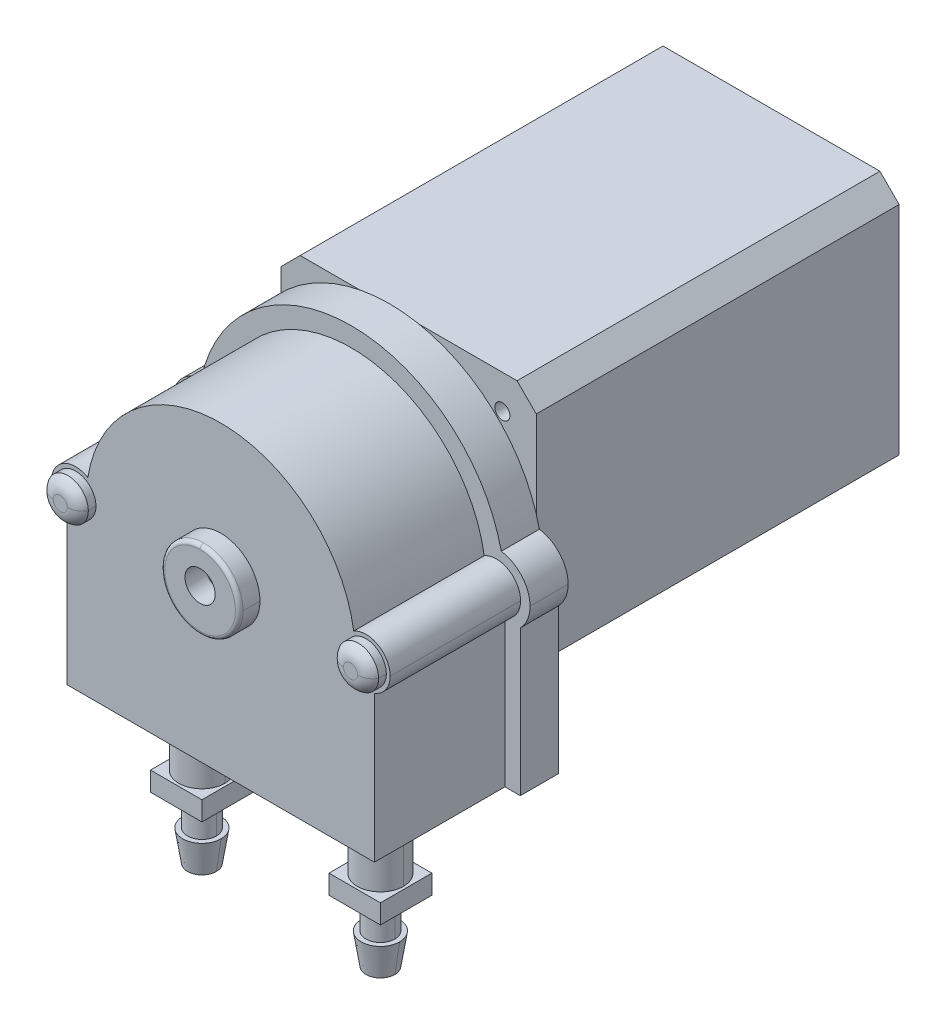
ISO-10303-21;
HEADER;
FILE_DESCRIPTION(('STEP AP214'),'2;1');
FILE_NAME('part.step','',(''),(''),'','','');
FILE_SCHEMA(('AUTOMOTIVE_DESIGN { 1 0 10303 214 1 1 1 1 }'));
ENDSEC;
DATA;
#1=APPLICATION_CONTEXT('core data for automotive mechanical design processes');
#2=APPLICATION_PROTOCOL_DEFINITION('international standard','automotive_design',2000,#1);
#3=PRODUCT_CONTEXT('',#1,'mechanical');
#4=PRODUCT('Part','Part','',(#3));
#5=PRODUCT_RELATED_PRODUCT_CATEGORY('part','',(#4));
#6=PRODUCT_DEFINITION_FORMATION('','',#4);
#7=PRODUCT_DEFINITION_CONTEXT('part definition',#1,'design');
#8=PRODUCT_DEFINITION('design','',#6,#7);
#9=PRODUCT_DEFINITION_SHAPE('','',#8);
#10=(LENGTH_UNIT() NAMED_UNIT(*) SI_UNIT(.MILLI.,.METRE.));
#11=(NAMED_UNIT(*) PLANE_ANGLE_UNIT() SI_UNIT($,.RADIAN.));
#12=(NAMED_UNIT(*) SI_UNIT($,.STERADIAN.) SOLID_ANGLE_UNIT());
#13=UNCERTAINTY_MEASURE_WITH_UNIT(LENGTH_MEASURE(1.E-05),#10,'distance_accuracy_value','');
#14=(GEOMETRIC_REPRESENTATION_CONTEXT(3) GLOBAL_UNCERTAINTY_ASSIGNED_CONTEXT((#13)) GLOBAL_UNIT_ASSIGNED_CONTEXT((#10,
#11,#12)) REPRESENTATION_CONTEXT('',''));
#15=CARTESIAN_POINT('',(0.,0.,0.));
#16=DIRECTION('',(0.,0.,1.));
#17=DIRECTION('',(1.,0.,0.));
#18=AXIS2_PLACEMENT_3D('',#15,#16,#17);
#19=CARTESIAN_POINT('',(172.863459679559,38.4048,29.6544211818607));
#20=DIRECTION('',(0.,0.,1.));
#21=DIRECTION('',(0.,-1.,0.));
#22=AXIS2_PLACEMENT_3D('',#19,#20,#21);
#23=PLANE('',#22);
#24=CARTESIAN_POINT('',(172.86345967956,39.0398,29.6544211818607));
#25=DIRECTION('',(0.,0.,1.));
#26=DIRECTION('',(0.,-1.,0.));
#27=AXIS2_PLACEMENT_3D('',#24,#25,#26);
#28=CIRCLE('',#27,2.49999999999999);
#29=CARTESIAN_POINT('',(172.86345967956,36.5398,29.6544211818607));
#30=VERTEX_POINT('',#29);
#31=EDGE_CURVE('E448',#30,#30,#28,.T.);
#32=ORIENTED_EDGE('',*,*,#31,.T.);
#33=EDGE_LOOP('',(#32));
#34=FACE_BOUND('',#33,.T.);
#35=CARTESIAN_POINT('',(172.863459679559,38.4048,29.6544211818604));
#36=DIRECTION('',(0.,0.,-1.));
#37=DIRECTION('',(1.,0.,0.));
#38=AXIS2_PLACEMENT_3D('',#35,#36,#37);
#39=CIRCLE('',#38,6.35);
#40=CARTESIAN_POINT('',(179.21345967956,38.4048,29.6544211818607));
#41=VERTEX_POINT('',#40);
#42=CARTESIAN_POINT('',(166.51345967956,38.4048,29.6544211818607));
#43=VERTEX_POINT('',#42);
#44=EDGE_CURVE('E508',#41,#43,#39,.T.);
#45=ORIENTED_EDGE('',*,*,#44,.T.);
#46=CARTESIAN_POINT('',(172.863459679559,38.4048,29.6544211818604));
#47=DIRECTION('',(0.,0.,-1.));
#48=DIRECTION('',(1.,0.,0.));
#49=AXIS2_PLACEMENT_3D('',#46,#47,#48);
#50=CIRCLE('',#49,6.35);
#51=EDGE_CURVE('E407',#43,#41,#50,.T.);
#52=ORIENTED_EDGE('',*,*,#51,.T.);
#53=EDGE_LOOP('',(#45,#52));
#54=FACE_BOUND('',#53,.T.);
#55=ADVANCED_FACE('F63',(#34,#54),#23,.F.);
#56=CARTESIAN_POINT('',(172.863459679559,38.4048,33.0834211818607));
#57=DIRECTION('',(0.,0.,1.));
#58=DIRECTION('',(0.,-1.,0.));
#59=AXIS2_PLACEMENT_3D('',#56,#57,#58);
#60=PLANE('',#59);
#61=CARTESIAN_POINT('',(172.86345967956,39.0398,33.0834211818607));
#62=DIRECTION('',(0.,0.,-1.));
#63=DIRECTION('',(-1.,0.,0.));
#64=AXIS2_PLACEMENT_3D('',#61,#62,#63);
#65=CIRCLE('',#64,2.49999999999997);
#66=CARTESIAN_POINT('',(170.36345967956,39.0398,33.0834211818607));
#67=VERTEX_POINT('',#66);
#68=EDGE_CURVE('E1292',#67,#67,#65,.T.);
#69=ORIENTED_EDGE('',*,*,#68,.T.);
#70=EDGE_LOOP('',(#69));
#71=FACE_BOUND('',#70,.T.);
#72=CARTESIAN_POINT('',(172.863459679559,38.4048,33.0834211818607));
#73=DIRECTION('',(0.,0.,-1.));
#74=DIRECTION('',(-1.,0.,0.));
#75=AXIS2_PLACEMENT_3D('',#72,#73,#74);
#76=CIRCLE('',#75,5.842);
#77=CARTESIAN_POINT('',(178.70545967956,38.4048,33.0834211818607));
#78=VERTEX_POINT('',#77);
#79=CARTESIAN_POINT('',(172.863459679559,32.5628,33.0834211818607));
#80=VERTEX_POINT('',#79);
#81=EDGE_CURVE('E402',#78,#80,#76,.T.);
#82=ORIENTED_EDGE('',*,*,#81,.F.);
#83=CARTESIAN_POINT('',(172.863459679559,38.4048,33.0834211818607));
#84=DIRECTION('',(0.,0.,-1.));
#85=DIRECTION('',(-1.,0.,0.));
#86=AXIS2_PLACEMENT_3D('',#83,#84,#85);
#87=CIRCLE('',#86,5.842);
#88=CARTESIAN_POINT('',(172.863459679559,44.2468,33.0834211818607));
#89=VERTEX_POINT('',#88);
#90=EDGE_CURVE('E399',#89,#78,#87,.T.);
#91=ORIENTED_EDGE('',*,*,#90,.F.);
#92=CARTESIAN_POINT('',(172.863459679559,38.4048,33.0834211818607));
#93=DIRECTION('',(0.,0.,-1.));
#94=DIRECTION('',(-1.,0.,0.));
#95=AXIS2_PLACEMENT_3D('',#92,#93,#94);
#96=CIRCLE('',#95,5.842);
#97=EDGE_CURVE('E12',#80,#89,#96,.T.);
#98=ORIENTED_EDGE('',*,*,#97,.F.);
#99=EDGE_LOOP('',(#82,#91,#98));
#100=FACE_BOUND('',#99,.T.);
#101=ADVANCED_FACE('F713',(#71,#100),#60,.T.);
#102=CARTESIAN_POINT('',(172.863459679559,38.4048,29.6544211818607));
#103=DIRECTION('',(0.,0.,1.));
#104=DIRECTION('',(1.,0.,0.));
#105=AXIS2_PLACEMENT_3D('',#102,#103,#104);
#106=CYLINDRICAL_SURFACE('',#105,6.477);
#107=DIRECTION('',(0.,0.,1.));
#108=VECTOR('',#107,1.);
#109=CARTESIAN_POINT('',(179.34045967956,38.4048,29.6544211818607));
#110=LINE('',#109,#108);
#111=CARTESIAN_POINT('',(179.34045967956,38.4048,29.6544211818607));
#112=VERTEX_POINT('',#111);
#113=CARTESIAN_POINT('',(179.34045967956,38.4048,32.4484211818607));
#114=VERTEX_POINT('',#113);
#115=EDGE_CURVE('E358',#112,#114,#110,.T.);
#116=ORIENTED_EDGE('',*,*,#115,.T.);
#117=CARTESIAN_POINT('',(172.863459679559,38.4048,32.4484211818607));
#118=DIRECTION('',(0.,0.,1.));
#119=DIRECTION('',(-1.,0.,0.));
#120=AXIS2_PLACEMENT_3D('',#117,#118,#119);
#121=CIRCLE('',#120,6.477);
#122=CARTESIAN_POINT('',(172.863459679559,31.9278,32.4484211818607));
#123=VERTEX_POINT('',#122);
#124=EDGE_CURVE('E392',#123,#114,#121,.T.);
#125=ORIENTED_EDGE('',*,*,#124,.F.);
#126=CARTESIAN_POINT('',(172.863459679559,38.4048,32.4484211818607));
#127=DIRECTION('',(0.,0.,1.));
#128=DIRECTION('',(-1.,0.,0.));
#129=AXIS2_PLACEMENT_3D('',#126,#127,#128);
#130=CIRCLE('',#129,6.477);
#131=CARTESIAN_POINT('',(166.386459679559,38.4048,32.4484211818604));
#132=VERTEX_POINT('',#131);
#133=EDGE_CURVE('E73',#132,#123,#130,.T.);
#134=ORIENTED_EDGE('',*,*,#133,.F.);
#135=DIRECTION('',(0.,0.,-1.));
#136=VECTOR('',#135,1.);
#137=CARTESIAN_POINT('',(166.386459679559,38.4048,29.6544211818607));
#138=LINE('',#137,#136);
#139=CARTESIAN_POINT('',(166.386459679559,38.4048,29.6544211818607));
#140=VERTEX_POINT('',#139);
#141=EDGE_CURVE('E357',#132,#140,#138,.T.);
#142=ORIENTED_EDGE('',*,*,#141,.T.);
#143=CARTESIAN_POINT('',(172.863459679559,38.4048,29.6544211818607));
#144=DIRECTION('',(0.,0.,1.));
#145=DIRECTION('',(1.,0.,0.));
#146=AXIS2_PLACEMENT_3D('',#143,#144,#145);
#147=CIRCLE('',#146,6.477);
#148=EDGE_CURVE('E565',#140,#112,#147,.T.);
#149=ORIENTED_EDGE('',*,*,#148,.T.);
#150=EDGE_LOOP('',(#116,#125,#134,#142,#149));
#151=FACE_BOUND('',#150,.T.);
#152=ADVANCED_FACE('F719',(#151),#106,.T.);
#153=CARTESIAN_POINT('',(172.863459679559,38.4048,32.4484211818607));
#154=DIRECTION('',(0.,0.,-1.));
#155=DIRECTION('',(0.,1.,0.));
#156=AXIS2_PLACEMENT_3D('',#153,#154,#155);
#157=TOROIDAL_SURFACE('',#156,5.842,0.635);
#158=CARTESIAN_POINT('',(172.863459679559,44.2468,32.4484211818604));
#159=DIRECTION('',(-1.,0.,0.));
#160=DIRECTION('',(0.,1.,0.));
#161=AXIS2_PLACEMENT_3D('',#158,#159,#160);
#162=CIRCLE('',#161,0.635);
#163=CARTESIAN_POINT('',(172.863459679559,44.8818,32.4484211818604));
#164=VERTEX_POINT('',#163);
#165=EDGE_CURVE('E403',#89,#164,#162,.T.);
#166=ORIENTED_EDGE('',*,*,#165,.T.);
#167=CARTESIAN_POINT('',(172.863459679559,38.4048,32.4484211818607));
#168=DIRECTION('',(0.,0.,1.));
#169=DIRECTION('',(-1.,0.,0.));
#170=AXIS2_PLACEMENT_3D('',#167,#168,#169);
#171=CIRCLE('',#170,6.477);
#172=EDGE_CURVE('E411',#164,#132,#171,.T.);
#173=ORIENTED_EDGE('',*,*,#172,.T.);
#174=ORIENTED_EDGE('',*,*,#133,.T.);
#175=CARTESIAN_POINT('',(172.863459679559,32.5628,32.4484211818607));
#176=DIRECTION('',(-1.,0.,0.));
#177=DIRECTION('',(0.,-1.,0.));
#178=AXIS2_PLACEMENT_3D('',#175,#176,#177);
#179=CIRCLE('',#178,0.635);
#180=EDGE_CURVE('E395',#123,#80,#179,.T.);
#181=ORIENTED_EDGE('',*,*,#180,.T.);
#182=ORIENTED_EDGE('',*,*,#97,.T.);
#183=EDGE_LOOP('',(#166,#173,#174,#181,#182));
#184=FACE_BOUND('',#183,.T.);
#185=ADVANCED_FACE('F65',(#184),#157,.T.);
#186=CARTESIAN_POINT('',(187.620859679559,10.4648,18.0212211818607));
#187=DIRECTION('',(0.,1.,0.));
#188=DIRECTION('',(1.,0.,0.));
#189=AXIS2_PLACEMENT_3D('',#186,#187,#188);
#190=CYLINDRICAL_SURFACE('',#189,3.81);
#191=DIRECTION('',(0.,-1.,0.));
#192=VECTOR('',#191,1.);
#193=CARTESIAN_POINT('',(191.430859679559,10.4648,18.0212211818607));
#194=LINE('',#193,#192);
#195=CARTESIAN_POINT('',(191.430859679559,10.4648,18.0212211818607));
#196=VERTEX_POINT('',#195);
#197=CARTESIAN_POINT('',(191.430859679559,-2.2352,18.0212211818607));
#198=VERTEX_POINT('',#197);
#199=EDGE_CURVE('E353',#196,#198,#194,.T.);
#200=ORIENTED_EDGE('',*,*,#199,.T.);
#201=CARTESIAN_POINT('',(187.620859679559,-2.2352,18.0212211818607));
#202=DIRECTION('',(0.,1.,0.));
#203=DIRECTION('',(1.,0.,0.));
#204=AXIS2_PLACEMENT_3D('',#201,#202,#203);
#205=CIRCLE('',#204,3.81);
#206=CARTESIAN_POINT('',(183.810859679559,-2.2352,18.0212211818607));
#207=VERTEX_POINT('',#206);
#208=EDGE_CURVE('E425',#198,#207,#205,.T.);
#209=ORIENTED_EDGE('',*,*,#208,.T.);
#210=DIRECTION('',(0.,1.,0.));
#211=VECTOR('',#210,1.);
#212=CARTESIAN_POINT('',(183.810859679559,10.4648,18.0212211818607));
#213=LINE('',#212,#211);
#214=CARTESIAN_POINT('',(183.810859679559,10.4648,18.0212211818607));
#215=VERTEX_POINT('',#214);
#216=EDGE_CURVE('E350',#207,#215,#213,.T.);
#217=ORIENTED_EDGE('',*,*,#216,.T.);
#218=CARTESIAN_POINT('',(187.620859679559,10.4648,18.0212211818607));
#219=DIRECTION('',(0.,1.,0.));
#220=DIRECTION('',(1.,0.,0.));
#221=AXIS2_PLACEMENT_3D('',#218,#219,#220);
#222=CIRCLE('',#221,3.81);
#223=EDGE_CURVE('E304',#196,#215,#222,.T.);
#224=ORIENTED_EDGE('',*,*,#223,.F.);
#225=EDGE_LOOP('',(#200,#209,#217,#224));
#226=FACE_BOUND('',#225,.T.);
#227=ADVANCED_FACE('F825',(#226),#190,.T.);
#228=CARTESIAN_POINT('',(187.620859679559,10.4648,18.0212211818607));
#229=DIRECTION('',(0.,1.,0.));
#230=DIRECTION('',(1.,0.,0.));
#231=AXIS2_PLACEMENT_3D('',#228,#229,#230);
#232=CYLINDRICAL_SURFACE('',#231,3.81);
#233=ORIENTED_EDGE('',*,*,#199,.F.);
#234=CARTESIAN_POINT('',(187.620859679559,10.4648,18.0212211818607));
#235=DIRECTION('',(0.,1.,0.));
#236=DIRECTION('',(1.,0.,0.));
#237=AXIS2_PLACEMENT_3D('',#234,#235,#236);
#238=CIRCLE('',#237,3.81);
#239=EDGE_CURVE('E391',#215,#196,#238,.T.);
#240=ORIENTED_EDGE('',*,*,#239,.F.);
#241=ORIENTED_EDGE('',*,*,#216,.F.);
#242=CARTESIAN_POINT('',(187.620859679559,-2.2352,18.0212211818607));
#243=DIRECTION('',(0.,1.,0.));
#244=DIRECTION('',(1.,0.,0.));
#245=AXIS2_PLACEMENT_3D('',#242,#243,#244);
#246=CIRCLE('',#245,3.81);
#247=EDGE_CURVE('E422',#207,#198,#246,.T.);
#248=ORIENTED_EDGE('',*,*,#247,.T.);
#249=EDGE_LOOP('',(#233,#240,#241,#248));
#250=FACE_BOUND('',#249,.T.);
#251=ADVANCED_FACE('F829',(#250),#232,.T.);
#252=CARTESIAN_POINT('',(103.119101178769,-5.4102,3.38801305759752));
#253=DIRECTION('',(0.,-1.,0.));
#254=DIRECTION('',(-1.,0.,0.));
#255=AXIS2_PLACEMENT_3D('',#252,#253,#254);
#256=PLANE('',#255);
#257=CARTESIAN_POINT('',(187.620859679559,-5.4102,18.0212211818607));
#258=DIRECTION('',(0.,1.,0.));
#259=DIRECTION('',(1.,0.,0.));
#260=AXIS2_PLACEMENT_3D('',#257,#258,#259);
#261=CIRCLE('',#260,2.3876);
#262=CARTESIAN_POINT('',(185.233259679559,-5.4102,18.0212211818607));
#263=VERTEX_POINT('',#262);
#264=CARTESIAN_POINT('',(190.00845967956,-5.4102,18.0212211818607));
#265=VERTEX_POINT('',#264);
#266=EDGE_CURVE('E375',#263,#265,#261,.T.);
#267=ORIENTED_EDGE('',*,*,#266,.T.);
#268=CARTESIAN_POINT('',(187.620859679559,-5.4102,18.0212211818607));
#269=DIRECTION('',(0.,1.,0.));
#270=DIRECTION('',(1.,0.,0.));
#271=AXIS2_PLACEMENT_3D('',#268,#269,#270);
#272=CIRCLE('',#271,2.3876);
#273=EDGE_CURVE('E344',#265,#263,#272,.T.);
#274=ORIENTED_EDGE('',*,*,#273,.T.);
#275=EDGE_LOOP('',(#267,#274));
#276=FACE_BOUND('',#275,.T.);
#277=DIRECTION('',(1.,0.,0.));
#278=VECTOR('',#277,1.);
#279=CARTESIAN_POINT('',(147.497230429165,-5.4102,22.2757211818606));
#280=LINE('',#279,#278);
#281=CARTESIAN_POINT('',(183.36635967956,-5.4102,22.2757211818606));
#282=VERTEX_POINT('',#281);
#283=CARTESIAN_POINT('',(191.875359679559,-5.4102,22.2757211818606));
#284=VERTEX_POINT('',#283);
#285=EDGE_CURVE('E526',#282,#284,#280,.T.);
#286=ORIENTED_EDGE('',*,*,#285,.F.);
#287=DIRECTION('',(0.,0.,1.));
#288=VECTOR('',#287,1.);
#289=CARTESIAN_POINT('',(183.36635967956,-5.4102,12.8318671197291));
#290=LINE('',#289,#288);
#291=CARTESIAN_POINT('',(183.36635967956,-5.4102,13.7667211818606));
#292=VERTEX_POINT('',#291);
#293=EDGE_CURVE('E82',#292,#282,#290,.T.);
#294=ORIENTED_EDGE('',*,*,#293,.F.);
#295=DIRECTION('',(-1.,0.,0.));
#296=VECTOR('',#295,1.);
#297=CARTESIAN_POINT('',(143.242730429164,-5.4102,13.7667211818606));
#298=LINE('',#297,#296);
#299=CARTESIAN_POINT('',(191.875359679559,-5.4102,13.7667211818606));
#300=VERTEX_POINT('',#299);
#301=EDGE_CURVE('E458',#300,#292,#298,.T.);
#302=ORIENTED_EDGE('',*,*,#301,.F.);
#303=DIRECTION('',(0.,0.,-1.));
#304=VECTOR('',#303,1.);
#305=CARTESIAN_POINT('',(191.875359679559,-5.4102,8.57736711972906));
#306=LINE('',#305,#304);
#307=EDGE_CURVE('E451',#284,#300,#306,.T.);
#308=ORIENTED_EDGE('',*,*,#307,.F.);
#309=EDGE_LOOP('',(#286,#294,#302,#308));
#310=FACE_BOUND('',#309,.T.);
#311=ADVANCED_FACE('F893',(#276,#310),#256,.T.);
#312=CARTESIAN_POINT('',(183.36635967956,-2.2352,18.0212211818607));
#313=DIRECTION('',(-1.,0.,0.));
#314=DIRECTION('',(0.,0.,1.));
#315=AXIS2_PLACEMENT_3D('',#312,#313,#314);
#316=PLANE('',#315);
#317=ORIENTED_EDGE('',*,*,#293,.T.);
#318=DIRECTION('',(0.,-1.,0.));
#319=VECTOR('',#318,1.);
#320=CARTESIAN_POINT('',(183.36635967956,-2.2352,22.2757211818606));
#321=LINE('',#320,#319);
#322=CARTESIAN_POINT('',(183.36635967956,-2.2352,22.2757211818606));
#323=VERTEX_POINT('',#322);
#324=EDGE_CURVE('E449',#323,#282,#321,.T.);
#325=ORIENTED_EDGE('',*,*,#324,.F.);
#326=DIRECTION('',(0.,0.,1.));
#327=VECTOR('',#326,1.);
#328=CARTESIAN_POINT('',(183.36635967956,-2.2352,12.8318671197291));
#329=LINE('',#328,#327);
#330=CARTESIAN_POINT('',(183.36635967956,-2.2352,13.7667211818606));
#331=VERTEX_POINT('',#330);
#332=EDGE_CURVE('E384',#331,#323,#329,.T.);
#333=ORIENTED_EDGE('',*,*,#332,.F.);
#334=DIRECTION('',(0.,-1.,0.));
#335=VECTOR('',#334,1.);
#336=CARTESIAN_POINT('',(183.36635967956,-2.2352,13.7667211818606));
#337=LINE('',#336,#335);
#338=EDGE_CURVE('E463',#331,#292,#337,.T.);
#339=ORIENTED_EDGE('',*,*,#338,.T.);
#340=EDGE_LOOP('',(#317,#325,#333,#339));
#341=FACE_BOUND('',#340,.T.);
#342=ADVANCED_FACE('F943',(#341),#316,.T.);
#343=CARTESIAN_POINT('',(187.620859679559,-2.2352,13.7667211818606));
#344=DIRECTION('',(0.,0.,-1.));
#345=DIRECTION('',(0.,-1.,0.));
#346=AXIS2_PLACEMENT_3D('',#343,#344,#345);
#347=PLANE('',#346);
#348=ORIENTED_EDGE('',*,*,#301,.T.);
#349=ORIENTED_EDGE('',*,*,#338,.F.);
#350=DIRECTION('',(-1.,0.,0.));
#351=VECTOR('',#350,1.);
#352=CARTESIAN_POINT('',(143.242730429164,-2.2352,13.7667211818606));
#353=LINE('',#352,#351);
#354=CARTESIAN_POINT('',(191.875359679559,-2.2352,13.7667211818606));
#355=VERTEX_POINT('',#354);
#356=EDGE_CURVE('E426',#355,#331,#353,.T.);
#357=ORIENTED_EDGE('',*,*,#356,.F.);
#358=DIRECTION('',(0.,-1.,0.));
#359=VECTOR('',#358,1.);
#360=CARTESIAN_POINT('',(191.875359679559,-2.2352,13.7667211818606));
#361=LINE('',#360,#359);
#362=EDGE_CURVE('E454',#355,#300,#361,.T.);
#363=ORIENTED_EDGE('',*,*,#362,.T.);
#364=EDGE_LOOP('',(#348,#349,#357,#363));
#365=FACE_BOUND('',#364,.T.);
#366=ADVANCED_FACE('F940',(#365),#347,.T.);
#367=CARTESIAN_POINT('',(191.875359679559,-2.2352,18.0212211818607));
#368=DIRECTION('',(1.,0.,0.));
#369=DIRECTION('',(0.,1.,0.));
#370=AXIS2_PLACEMENT_3D('',#367,#368,#369);
#371=PLANE('',#370);
#372=ORIENTED_EDGE('',*,*,#307,.T.);
#373=ORIENTED_EDGE('',*,*,#362,.F.);
#374=DIRECTION('',(0.,0.,-1.));
#375=VECTOR('',#374,1.);
#376=CARTESIAN_POINT('',(191.875359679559,-2.2352,8.57736711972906));
#377=LINE('',#376,#375);
#378=CARTESIAN_POINT('',(191.875359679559,-2.2352,22.2757211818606));
#379=VERTEX_POINT('',#378);
#380=EDGE_CURVE('E524',#379,#355,#377,.T.);
#381=ORIENTED_EDGE('',*,*,#380,.F.);
#382=DIRECTION('',(0.,-1.,0.));
#383=VECTOR('',#382,1.);
#384=CARTESIAN_POINT('',(191.875359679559,-2.2352,22.2757211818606));
#385=LINE('',#384,#383);
#386=EDGE_CURVE('E452',#379,#284,#385,.T.);
#387=ORIENTED_EDGE('',*,*,#386,.T.);
#388=EDGE_LOOP('',(#372,#373,#381,#387));
#389=FACE_BOUND('',#388,.T.);
#390=ADVANCED_FACE('F942',(#389),#371,.T.);
#391=CARTESIAN_POINT('',(187.620859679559,-2.2352,22.2757211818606));
#392=DIRECTION('',(0.,0.,1.));
#393=DIRECTION('',(0.,-1.,0.));
#394=AXIS2_PLACEMENT_3D('',#391,#392,#393);
#395=PLANE('',#394);
#396=ORIENTED_EDGE('',*,*,#285,.T.);
#397=ORIENTED_EDGE('',*,*,#386,.F.);
#398=DIRECTION('',(1.,0.,0.));
#399=VECTOR('',#398,1.);
#400=CARTESIAN_POINT('',(147.497230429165,-2.2352,22.2757211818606));
#401=LINE('',#400,#399);
#402=EDGE_CURVE('E387',#323,#379,#401,.T.);
#403=ORIENTED_EDGE('',*,*,#402,.F.);
#404=ORIENTED_EDGE('',*,*,#324,.T.);
#405=EDGE_LOOP('',(#396,#397,#403,#404));
#406=FACE_BOUND('',#405,.T.);
#407=ADVANCED_FACE('F730',(#406),#395,.T.);
#408=CARTESIAN_POINT('',(103.119101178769,-2.2352,3.38801305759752));
#409=DIRECTION('',(0.,-1.,0.));
#410=DIRECTION('',(-1.,0.,0.));
#411=AXIS2_PLACEMENT_3D('',#408,#409,#410);
#412=PLANE('',#411);
#413=ORIENTED_EDGE('',*,*,#247,.F.);
#414=ORIENTED_EDGE('',*,*,#208,.F.);
#415=EDGE_LOOP('',(#413,#414));
#416=FACE_BOUND('',#415,.T.);
#417=ORIENTED_EDGE('',*,*,#332,.T.);
#418=ORIENTED_EDGE('',*,*,#402,.T.);
#419=ORIENTED_EDGE('',*,*,#380,.T.);
#420=ORIENTED_EDGE('',*,*,#356,.T.);
#421=EDGE_LOOP('',(#417,#418,#419,#420));
#422=FACE_BOUND('',#421,.T.);
#423=ADVANCED_FACE('F727',(#416,#422),#412,.F.);
#424=CARTESIAN_POINT('',(234.006003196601,61.9627026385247,8.08982118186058));
#425=DIRECTION('',(0.,0.,1.));
#426=DIRECTION('',(0.,-1.,0.));
#427=AXIS2_PLACEMENT_3D('',#424,#425,#426);
#428=PLANE('',#427);
#429=CARTESIAN_POINT('',(172.863459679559,38.4048,8.08982118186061));
#430=DIRECTION('',(0.,0.,-1.));
#431=DIRECTION('',(1.,0.,0.));
#432=AXIS2_PLACEMENT_3D('',#429,#430,#431);
#433=CIRCLE('',#432,6.35);
#434=CARTESIAN_POINT('',(179.21345967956,38.4048,8.08982118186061));
#435=VERTEX_POINT('',#434);
#436=CARTESIAN_POINT('',(166.51345967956,38.4048,8.08982118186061));
#437=VERTEX_POINT('',#436);
#438=EDGE_CURVE('E483',#435,#437,#433,.T.);
#439=ORIENTED_EDGE('',*,*,#438,.F.);
#440=CARTESIAN_POINT('',(172.863459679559,38.4048,8.08982118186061));
#441=DIRECTION('',(0.,0.,-1.));
#442=DIRECTION('',(1.,0.,0.));
#443=AXIS2_PLACEMENT_3D('',#440,#441,#442);
#444=CIRCLE('',#443,6.35);
#445=EDGE_CURVE('E404',#437,#435,#444,.T.);
#446=ORIENTED_EDGE('',*,*,#445,.F.);
#447=EDGE_LOOP('',(#439,#446));
#448=FACE_BOUND('',#447,.T.);
#449=CARTESIAN_POINT('',(148.86045967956,38.4048,8.08982118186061));
#450=DIRECTION('',(0.,0.,-1.));
#451=DIRECTION('',(1.,0.,0.));
#452=AXIS2_PLACEMENT_3D('',#449,#450,#451);
#453=CIRCLE('',#452,2.7813);
#454=CARTESIAN_POINT('',(151.641759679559,38.4048,8.08982118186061));
#455=VERTEX_POINT('',#454);
#456=CARTESIAN_POINT('',(146.07915967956,38.4048,8.08982118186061));
#457=VERTEX_POINT('',#456);
#458=EDGE_CURVE('E321',#455,#457,#453,.T.);
#459=ORIENTED_EDGE('',*,*,#458,.F.);
#460=CARTESIAN_POINT('',(148.86045967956,38.4048,8.08982118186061));
#461=DIRECTION('',(0.,0.,-1.));
#462=DIRECTION('',(1.,0.,0.));
#463=AXIS2_PLACEMENT_3D('',#460,#461,#462);
#464=CIRCLE('',#463,2.7813);
#465=EDGE_CURVE('E627',#457,#455,#464,.T.);
#466=ORIENTED_EDGE('',*,*,#465,.F.);
#467=EDGE_LOOP('',(#459,#466));
#468=FACE_BOUND('',#467,.T.);
#469=CARTESIAN_POINT('',(196.866459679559,38.4048,8.08982118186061));
#470=DIRECTION('',(0.,0.,-1.));
#471=DIRECTION('',(1.,0.,0.));
#472=AXIS2_PLACEMENT_3D('',#469,#470,#471);
#473=CIRCLE('',#472,2.7813);
#474=CARTESIAN_POINT('',(199.647759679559,38.4048,8.08982118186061));
#475=VERTEX_POINT('',#474);
#476=CARTESIAN_POINT('',(194.085159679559,38.4048,8.08982118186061));
#477=VERTEX_POINT('',#476);
#478=EDGE_CURVE('E501',#475,#477,#473,.T.);
#479=ORIENTED_EDGE('',*,*,#478,.F.);
#480=CARTESIAN_POINT('',(196.866459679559,38.4048,8.08982118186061));
#481=DIRECTION('',(0.,0.,-1.));
#482=DIRECTION('',(1.,0.,0.));
#483=AXIS2_PLACEMENT_3D('',#480,#481,#482);
#484=CIRCLE('',#483,2.7813);
#485=EDGE_CURVE('E339',#477,#475,#484,.T.);
#486=ORIENTED_EDGE('',*,*,#485,.F.);
#487=EDGE_LOOP('',(#479,#486));
#488=FACE_BOUND('',#487,.T.);
#489=DIRECTION('',(-1.,0.,0.));
#490=VECTOR('',#489,1.);
#491=CARTESIAN_POINT('',(190.734731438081,10.4648,8.08982118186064));
#492=LINE('',#491,#490);
#493=CARTESIAN_POINT('',(198.26345967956,10.4648,8.08982118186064));
#494=VERTEX_POINT('',#493);
#495=CARTESIAN_POINT('',(147.46345967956,10.4648,8.08982118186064));
#496=VERTEX_POINT('',#495);
#497=EDGE_CURVE('E343',#494,#496,#492,.T.);
#498=ORIENTED_EDGE('',*,*,#497,.T.);
#499=DIRECTION('',(0.,-1.,0.));
#500=VECTOR('',#499,1.);
#501=CARTESIAN_POINT('',(147.46345967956,36.2137513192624,8.08982118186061));
#502=LINE('',#501,#500);
#503=CARTESIAN_POINT('',(147.46345967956,34.6561480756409,8.08982118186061));
#504=VERTEX_POINT('',#503);
#505=EDGE_CURVE('E406',#504,#496,#502,.T.);
#506=ORIENTED_EDGE('',*,*,#505,.F.);
#507=CARTESIAN_POINT('',(148.86045967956,38.4048,8.08982118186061));
#508=DIRECTION('',(0.,0.,-1.));
#509=DIRECTION('',(1.,0.,0.));
#510=AXIS2_PLACEMENT_3D('',#507,#508,#509);
#511=CIRCLE('',#510,4.0005);
#512=CARTESIAN_POINT('',(144.85995967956,38.4048,8.08982118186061));
#513=VERTEX_POINT('',#512);
#514=EDGE_CURVE('E322',#504,#513,#511,.T.);
#515=ORIENTED_EDGE('',*,*,#514,.T.);
#516=CARTESIAN_POINT('',(148.86045967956,38.4048,8.08982118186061));
#517=DIRECTION('',(0.,0.,-1.));
#518=DIRECTION('',(1.,0.,0.));
#519=AXIS2_PLACEMENT_3D('',#516,#517,#518);
#520=CIRCLE('',#519,4.0005);
#521=CARTESIAN_POINT('',(150.882450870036,41.8566910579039,8.08982118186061));
#522=VERTEX_POINT('',#521);
#523=EDGE_CURVE('E338',#513,#522,#520,.T.);
#524=ORIENTED_EDGE('',*,*,#523,.T.);
#525=CARTESIAN_POINT('',(172.863459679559,38.4048,8.08982118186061));
#526=DIRECTION('',(0.,0.,-1.));
#527=DIRECTION('',(1.,0.,0.));
#528=AXIS2_PLACEMENT_3D('',#525,#526,#527);
#529=CIRCLE('',#528,22.2504);
#530=CARTESIAN_POINT('',(194.844468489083,41.8566910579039,8.08982118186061));
#531=VERTEX_POINT('',#530);
#532=EDGE_CURVE('E283',#522,#531,#529,.T.);
#533=ORIENTED_EDGE('',*,*,#532,.T.);
#534=CARTESIAN_POINT('',(196.866459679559,38.4048,8.08982118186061));
#535=DIRECTION('',(0.,0.,-1.));
#536=DIRECTION('',(1.,0.,0.));
#537=AXIS2_PLACEMENT_3D('',#534,#535,#536);
#538=CIRCLE('',#537,4.0005);
#539=CARTESIAN_POINT('',(200.866959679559,38.4048,8.08982118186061));
#540=VERTEX_POINT('',#539);
#541=EDGE_CURVE('E278',#531,#540,#538,.T.);
#542=ORIENTED_EDGE('',*,*,#541,.T.);
#543=CARTESIAN_POINT('',(196.866459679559,38.4048,8.08982118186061));
#544=DIRECTION('',(0.,0.,-1.));
#545=DIRECTION('',(1.,0.,0.));
#546=AXIS2_PLACEMENT_3D('',#543,#544,#545);
#547=CIRCLE('',#546,4.0005);
#548=CARTESIAN_POINT('',(198.26345967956,34.6561480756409,8.08982118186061));
#549=VERTEX_POINT('',#548);
#550=EDGE_CURVE('E265',#540,#549,#547,.T.);
#551=ORIENTED_EDGE('',*,*,#550,.T.);
#552=DIRECTION('',(0.,-1.,0.));
#553=VECTOR('',#552,1.);
#554=CARTESIAN_POINT('',(198.26345967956,36.2137513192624,8.08982118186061));
#555=LINE('',#554,#553);
#556=EDGE_CURVE('E388',#549,#494,#555,.T.);
#557=ORIENTED_EDGE('',*,*,#556,.T.);
#558=EDGE_LOOP('',(#498,#506,#515,#524,#533,#542,#551,#557));
#559=FACE_BOUND('',#558,.T.);
#560=ADVANCED_FACE('F280',(#448,#468,#488,#559),#428,.F.);
#561=CARTESIAN_POINT('',(198.26345967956,22.5604740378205,8.08982118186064));
#562=DIRECTION('',(1.,0.,0.));
#563=DIRECTION('',(0.,1.,0.));
#564=AXIS2_PLACEMENT_3D('',#561,#562,#563);
#565=PLANE('',#564);
#566=DIRECTION('',(0.,-1.,0.));
#567=VECTOR('',#566,1.);
#568=CARTESIAN_POINT('',(198.26345967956,36.2137513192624,29.6544211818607));
#569=LINE('',#568,#567);
#570=CARTESIAN_POINT('',(198.26345967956,34.6561480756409,29.6544211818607));
#571=VERTEX_POINT('',#570);
#572=CARTESIAN_POINT('',(198.26345967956,10.4648,29.6544211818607));
#573=VERTEX_POINT('',#572);
#574=EDGE_CURVE('E504',#571,#573,#569,.T.);
#575=ORIENTED_EDGE('',*,*,#574,.T.);
#576=DIRECTION('',(0.,0.,1.));
#577=VECTOR('',#576,1.);
#578=CARTESIAN_POINT('',(198.26345967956,10.4648,8.08982118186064));
#579=LINE('',#578,#577);
#580=EDGE_CURVE('E589',#494,#573,#579,.T.);
#581=ORIENTED_EDGE('',*,*,#580,.F.);
#582=ORIENTED_EDGE('',*,*,#556,.F.);
#583=DIRECTION('',(0.,0.,1.));
#584=VECTOR('',#583,1.);
#585=CARTESIAN_POINT('',(198.26345967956,34.6561480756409,8.08982118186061));
#586=LINE('',#585,#584);
#587=EDGE_CURVE('E273',#549,#571,#586,.T.);
#588=ORIENTED_EDGE('',*,*,#587,.T.);
#589=EDGE_LOOP('',(#575,#581,#582,#588));
#590=FACE_BOUND('',#589,.T.);
#591=ADVANCED_FACE('F765',(#590),#565,.T.);
#592=CARTESIAN_POINT('',(172.863459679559,38.4048,8.08982118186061));
#593=DIRECTION('',(0.,0.,-1.));
#594=DIRECTION('',(1.,0.,0.));
#595=AXIS2_PLACEMENT_3D('',#592,#593,#594);
#596=CYLINDRICAL_SURFACE('',#595,22.2504);
#597=CARTESIAN_POINT('',(172.863459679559,38.4048,29.6544211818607));
#598=DIRECTION('',(0.,0.,-1.));
#599=DIRECTION('',(1.,0.,0.));
#600=AXIS2_PLACEMENT_3D('',#597,#598,#599);
#601=CIRCLE('',#600,22.2504);
#602=CARTESIAN_POINT('',(150.882450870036,41.8566910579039,29.6544211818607));
#603=VERTEX_POINT('',#602);
#604=CARTESIAN_POINT('',(194.844468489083,41.8566910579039,29.6544211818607));
#605=VERTEX_POINT('',#604);
#606=EDGE_CURVE('E579',#603,#605,#601,.T.);
#607=ORIENTED_EDGE('',*,*,#606,.T.);
#608=DIRECTION('',(0.,0.,1.));
#609=VECTOR('',#608,1.);
#610=CARTESIAN_POINT('',(194.844468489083,41.8566910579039,8.08982118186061));
#611=LINE('',#610,#609);
#612=EDGE_CURVE('E292',#531,#605,#611,.T.);
#613=ORIENTED_EDGE('',*,*,#612,.F.);
#614=ORIENTED_EDGE('',*,*,#532,.F.);
#615=DIRECTION('',(0.,0.,1.));
#616=VECTOR('',#615,1.);
#617=CARTESIAN_POINT('',(150.882450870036,41.8566910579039,8.08982118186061));
#618=LINE('',#617,#616);
#619=EDGE_CURVE('E335',#522,#603,#618,.T.);
#620=ORIENTED_EDGE('',*,*,#619,.T.);
#621=EDGE_LOOP('',(#607,#613,#614,#620));
#622=FACE_BOUND('',#621,.T.);
#623=ADVANCED_FACE('F762',(#622),#596,.T.);
#624=CARTESIAN_POINT('',(147.46345967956,22.5604740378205,8.08982118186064));
#625=DIRECTION('',(-1.,0.,0.));
#626=DIRECTION('',(0.,0.,1.));
#627=AXIS2_PLACEMENT_3D('',#624,#625,#626);
#628=PLANE('',#627);
#629=DIRECTION('',(0.,1.,0.));
#630=VECTOR('',#629,1.);
#631=CARTESIAN_POINT('',(147.46345967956,36.2137513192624,29.6544211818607));
#632=LINE('',#631,#630);
#633=CARTESIAN_POINT('',(147.46345967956,10.4648,29.6544211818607));
#634=VERTEX_POINT('',#633);
#635=CARTESIAN_POINT('',(147.46345967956,34.6561480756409,29.6544211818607));
#636=VERTEX_POINT('',#635);
#637=EDGE_CURVE('E359',#634,#636,#632,.T.);
#638=ORIENTED_EDGE('',*,*,#637,.T.);
#639=DIRECTION('',(0.,0.,1.));
#640=VECTOR('',#639,1.);
#641=CARTESIAN_POINT('',(147.46345967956,34.6561480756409,8.08982118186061));
#642=LINE('',#641,#640);
#643=EDGE_CURVE('E325',#504,#636,#642,.T.);
#644=ORIENTED_EDGE('',*,*,#643,.F.);
#645=ORIENTED_EDGE('',*,*,#505,.T.);
#646=DIRECTION('',(0.,0.,1.));
#647=VECTOR('',#646,1.);
#648=CARTESIAN_POINT('',(147.46345967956,10.4648,8.08982118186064));
#649=LINE('',#648,#647);
#650=EDGE_CURVE('E340',#496,#634,#649,.T.);
#651=ORIENTED_EDGE('',*,*,#650,.T.);
#652=EDGE_LOOP('',(#638,#644,#645,#651));
#653=FACE_BOUND('',#652,.T.);
#654=ADVANCED_FACE('F764',(#653),#628,.T.);
#655=CARTESIAN_POINT('',(172.863459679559,38.4048,8.08982118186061));
#656=DIRECTION('',(0.,0.,-1.));
#657=DIRECTION('',(1.,0.,0.));
#658=AXIS2_PLACEMENT_3D('',#655,#656,#657);
#659=CYLINDRICAL_SURFACE('',#658,6.35);
#660=DIRECTION('',(0.,0.,1.));
#661=VECTOR('',#660,1.);
#662=CARTESIAN_POINT('',(179.21345967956,38.4048,8.08982118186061));
#663=LINE('',#662,#661);
#664=EDGE_CURVE('E487',#435,#41,#663,.T.);
#665=ORIENTED_EDGE('',*,*,#664,.T.);
#666=ORIENTED_EDGE('',*,*,#51,.F.);
#667=DIRECTION('',(0.,0.,-1.));
#668=VECTOR('',#667,1.);
#669=CARTESIAN_POINT('',(166.51345967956,38.4048,8.08982118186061));
#670=LINE('',#669,#668);
#671=EDGE_CURVE('E486',#43,#437,#670,.T.);
#672=ORIENTED_EDGE('',*,*,#671,.T.);
#673=ORIENTED_EDGE('',*,*,#445,.T.);
#674=EDGE_LOOP('',(#665,#666,#672,#673));
#675=FACE_BOUND('',#674,.T.);
#676=ADVANCED_FACE('F735',(#675),#659,.F.);
#677=CARTESIAN_POINT('',(172.863459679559,38.4048,8.08982118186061));
#678=DIRECTION('',(0.,0.,-1.));
#679=DIRECTION('',(1.,0.,0.));
#680=AXIS2_PLACEMENT_3D('',#677,#678,#679);
#681=CYLINDRICAL_SURFACE('',#680,6.35);
#682=ORIENTED_EDGE('',*,*,#664,.F.);
#683=ORIENTED_EDGE('',*,*,#438,.T.);
#684=ORIENTED_EDGE('',*,*,#671,.F.);
#685=ORIENTED_EDGE('',*,*,#44,.F.);
#686=EDGE_LOOP('',(#682,#683,#684,#685));
#687=FACE_BOUND('',#686,.T.);
#688=ADVANCED_FACE('F732',(#687),#681,.F.);
#689=CARTESIAN_POINT('',(148.86045967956,38.4048,8.08982118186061));
#690=DIRECTION('',(0.,0.,-1.));
#691=DIRECTION('',(1.,0.,0.));
#692=AXIS2_PLACEMENT_3D('',#689,#690,#691);
#693=CYLINDRICAL_SURFACE('',#692,2.7813);
#694=DIRECTION('',(0.,0.,1.));
#695=VECTOR('',#694,1.);
#696=CARTESIAN_POINT('',(151.641759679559,38.4048,8.08982118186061));
#697=LINE('',#696,#695);
#698=CARTESIAN_POINT('',(151.641759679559,38.4048,29.6544211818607));
#699=VERTEX_POINT('',#698);
#700=EDGE_CURVE('E318',#455,#699,#697,.T.);
#701=ORIENTED_EDGE('',*,*,#700,.T.);
#702=CARTESIAN_POINT('',(148.86045967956,38.4048,29.6544211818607));
#703=DIRECTION('',(0.,0.,1.));
#704=DIRECTION('',(1.,0.,0.));
#705=AXIS2_PLACEMENT_3D('',#702,#703,#704);
#706=CIRCLE('',#705,2.7813);
#707=CARTESIAN_POINT('',(146.07915967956,38.4048,29.6544211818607));
#708=VERTEX_POINT('',#707);
#709=EDGE_CURVE('E521',#699,#708,#706,.T.);
#710=ORIENTED_EDGE('',*,*,#709,.T.);
#711=DIRECTION('',(0.,0.,-1.));
#712=VECTOR('',#711,1.);
#713=CARTESIAN_POINT('',(146.07915967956,38.4048,8.08982118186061));
#714=LINE('',#713,#712);
#715=EDGE_CURVE('E533',#708,#457,#714,.T.);
#716=ORIENTED_EDGE('',*,*,#715,.T.);
#717=ORIENTED_EDGE('',*,*,#465,.T.);
#718=EDGE_LOOP('',(#701,#710,#716,#717));
#719=FACE_BOUND('',#718,.T.);
#720=ADVANCED_FACE('F693',(#719),#693,.F.);
#721=CARTESIAN_POINT('',(148.86045967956,38.4048,8.08982118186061));
#722=DIRECTION('',(0.,0.,-1.));
#723=DIRECTION('',(1.,0.,0.));
#724=AXIS2_PLACEMENT_3D('',#721,#722,#723);
#725=CYLINDRICAL_SURFACE('',#724,2.7813);
#726=ORIENTED_EDGE('',*,*,#700,.F.);
#727=ORIENTED_EDGE('',*,*,#458,.T.);
#728=ORIENTED_EDGE('',*,*,#715,.F.);
#729=CARTESIAN_POINT('',(148.86045967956,38.4048,29.6544211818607));
#730=DIRECTION('',(0.,0.,1.));
#731=DIRECTION('',(1.,0.,0.));
#732=AXIS2_PLACEMENT_3D('',#729,#730,#731);
#733=CIRCLE('',#732,2.7813);
#734=EDGE_CURVE('E517',#708,#699,#733,.T.);
#735=ORIENTED_EDGE('',*,*,#734,.T.);
#736=EDGE_LOOP('',(#726,#727,#728,#735));
#737=FACE_BOUND('',#736,.T.);
#738=ADVANCED_FACE('F695',(#737),#725,.F.);
#739=CARTESIAN_POINT('',(148.86045967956,38.4048,8.08982118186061));
#740=DIRECTION('',(0.,0.,-1.));
#741=DIRECTION('',(1.,0.,0.));
#742=AXIS2_PLACEMENT_3D('',#739,#740,#741);
#743=CYLINDRICAL_SURFACE('',#742,4.0005);
#744=ORIENTED_EDGE('',*,*,#643,.T.);
#745=CARTESIAN_POINT('',(148.86045967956,38.4048,29.6544211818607));
#746=DIRECTION('',(0.,0.,-1.));
#747=DIRECTION('',(1.,0.,0.));
#748=AXIS2_PLACEMENT_3D('',#745,#746,#747);
#749=CIRCLE('',#748,4.0005);
#750=CARTESIAN_POINT('',(144.85995967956,38.4048,29.6544211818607));
#751=VERTEX_POINT('',#750);
#752=EDGE_CURVE('E566',#636,#751,#749,.T.);
#753=ORIENTED_EDGE('',*,*,#752,.T.);
#754=DIRECTION('',(0.,0.,-1.));
#755=VECTOR('',#754,1.);
#756=CARTESIAN_POINT('',(144.85995967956,38.4048,8.08982118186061));
#757=LINE('',#756,#755);
#758=EDGE_CURVE('E364',#751,#513,#757,.T.);
#759=ORIENTED_EDGE('',*,*,#758,.T.);
#760=ORIENTED_EDGE('',*,*,#514,.F.);
#761=EDGE_LOOP('',(#744,#753,#759,#760));
#762=FACE_BOUND('',#761,.T.);
#763=ADVANCED_FACE('F808',(#762),#743,.T.);
#764=CARTESIAN_POINT('',(148.86045967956,38.4048,8.08982118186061));
#765=DIRECTION('',(0.,0.,-1.));
#766=DIRECTION('',(1.,0.,0.));
#767=AXIS2_PLACEMENT_3D('',#764,#765,#766);
#768=CYLINDRICAL_SURFACE('',#767,4.0005);
#769=ORIENTED_EDGE('',*,*,#619,.F.);
#770=ORIENTED_EDGE('',*,*,#523,.F.);
#771=ORIENTED_EDGE('',*,*,#758,.F.);
#772=CARTESIAN_POINT('',(148.86045967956,38.4048,29.6544211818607));
#773=DIRECTION('',(0.,0.,-1.));
#774=DIRECTION('',(1.,0.,0.));
#775=AXIS2_PLACEMENT_3D('',#772,#773,#774);
#776=CIRCLE('',#775,4.0005);
#777=EDGE_CURVE('E572',#751,#603,#776,.T.);
#778=ORIENTED_EDGE('',*,*,#777,.T.);
#779=EDGE_LOOP('',(#769,#770,#771,#778));
#780=FACE_BOUND('',#779,.T.);
#781=ADVANCED_FACE('F908',(#780),#768,.T.);
#782=CARTESIAN_POINT('',(196.866459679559,38.4048,8.08982118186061));
#783=DIRECTION('',(0.,0.,-1.));
#784=DIRECTION('',(1.,0.,0.));
#785=AXIS2_PLACEMENT_3D('',#782,#783,#784);
#786=CYLINDRICAL_SURFACE('',#785,2.7813);
#787=DIRECTION('',(0.,0.,1.));
#788=VECTOR('',#787,1.);
#789=CARTESIAN_POINT('',(199.647759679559,38.4048,8.08982118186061));
#790=LINE('',#789,#788);
#791=CARTESIAN_POINT('',(199.647759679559,38.4048,29.6544211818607));
#792=VERTEX_POINT('',#791);
#793=EDGE_CURVE('E275',#475,#792,#790,.T.);
#794=ORIENTED_EDGE('',*,*,#793,.T.);
#795=CARTESIAN_POINT('',(196.866459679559,38.4048,29.6544211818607));
#796=DIRECTION('',(0.,0.,1.));
#797=DIRECTION('',(1.,0.,0.));
#798=AXIS2_PLACEMENT_3D('',#795,#796,#797);
#799=CIRCLE('',#798,2.7813);
#800=CARTESIAN_POINT('',(194.085159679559,38.4048,29.6544211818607));
#801=VERTEX_POINT('',#800);
#802=EDGE_CURVE('E412',#792,#801,#799,.T.);
#803=ORIENTED_EDGE('',*,*,#802,.T.);
#804=DIRECTION('',(0.,0.,-1.));
#805=VECTOR('',#804,1.);
#806=CARTESIAN_POINT('',(194.085159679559,38.4048,8.08982118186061));
#807=LINE('',#806,#805);
#808=EDGE_CURVE('E441',#801,#477,#807,.T.);
#809=ORIENTED_EDGE('',*,*,#808,.T.);
#810=ORIENTED_EDGE('',*,*,#485,.T.);
#811=EDGE_LOOP('',(#794,#803,#809,#810));
#812=FACE_BOUND('',#811,.T.);
#813=ADVANCED_FACE('F914',(#812),#786,.F.);
#814=CARTESIAN_POINT('',(196.866459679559,38.4048,8.08982118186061));
#815=DIRECTION('',(0.,0.,-1.));
#816=DIRECTION('',(1.,0.,0.));
#817=AXIS2_PLACEMENT_3D('',#814,#815,#816);
#818=CYLINDRICAL_SURFACE('',#817,2.7813);
#819=ORIENTED_EDGE('',*,*,#793,.F.);
#820=ORIENTED_EDGE('',*,*,#478,.T.);
#821=ORIENTED_EDGE('',*,*,#808,.F.);
#822=CARTESIAN_POINT('',(196.866459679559,38.4048,29.6544211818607));
#823=DIRECTION('',(0.,0.,1.));
#824=DIRECTION('',(1.,0.,0.));
#825=AXIS2_PLACEMENT_3D('',#822,#823,#824);
#826=CIRCLE('',#825,2.7813);
#827=EDGE_CURVE('E416',#801,#792,#826,.T.);
#828=ORIENTED_EDGE('',*,*,#827,.T.);
#829=EDGE_LOOP('',(#819,#820,#821,#828));
#830=FACE_BOUND('',#829,.T.);
#831=ADVANCED_FACE('F929',(#830),#818,.F.);
#832=CARTESIAN_POINT('',(196.866459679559,38.4048,8.08982118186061));
#833=DIRECTION('',(0.,0.,-1.));
#834=DIRECTION('',(1.,0.,0.));
#835=AXIS2_PLACEMENT_3D('',#832,#833,#834);
#836=CYLINDRICAL_SURFACE('',#835,4.0005);
#837=ORIENTED_EDGE('',*,*,#587,.F.);
#838=ORIENTED_EDGE('',*,*,#550,.F.);
#839=DIRECTION('',(0.,0.,1.));
#840=VECTOR('',#839,1.);
#841=CARTESIAN_POINT('',(200.866959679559,38.4048,8.08982118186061));
#842=LINE('',#841,#840);
#843=CARTESIAN_POINT('',(200.866959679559,38.4048,29.6544211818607));
#844=VERTEX_POINT('',#843);
#845=EDGE_CURVE('E270',#540,#844,#842,.T.);
#846=ORIENTED_EDGE('',*,*,#845,.T.);
#847=CARTESIAN_POINT('',(196.866459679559,38.4048,29.6544211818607));
#848=DIRECTION('',(0.,0.,-1.));
#849=DIRECTION('',(1.,0.,0.));
#850=AXIS2_PLACEMENT_3D('',#847,#848,#849);
#851=CIRCLE('',#850,4.0005);
#852=EDGE_CURVE('E502',#844,#571,#851,.T.);
#853=ORIENTED_EDGE('',*,*,#852,.T.);
#854=EDGE_LOOP('',(#837,#838,#846,#853));
#855=FACE_BOUND('',#854,.T.);
#856=ADVANCED_FACE('F267',(#855),#836,.T.);
#857=CARTESIAN_POINT('',(196.866459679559,38.4048,8.08982118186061));
#858=DIRECTION('',(0.,0.,-1.));
#859=DIRECTION('',(1.,0.,0.));
#860=AXIS2_PLACEMENT_3D('',#857,#858,#859);
#861=CYLINDRICAL_SURFACE('',#860,4.0005);
#862=ORIENTED_EDGE('',*,*,#612,.T.);
#863=CARTESIAN_POINT('',(196.866459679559,38.4048,29.6544211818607));
#864=DIRECTION('',(0.,0.,-1.));
#865=DIRECTION('',(1.,0.,0.));
#866=AXIS2_PLACEMENT_3D('',#863,#864,#865);
#867=CIRCLE('',#866,4.0005);
#868=EDGE_CURVE('E290',#605,#844,#867,.T.);
#869=ORIENTED_EDGE('',*,*,#868,.T.);
#870=ORIENTED_EDGE('',*,*,#845,.F.);
#871=ORIENTED_EDGE('',*,*,#541,.F.);
#872=EDGE_LOOP('',(#862,#869,#870,#871));
#873=FACE_BOUND('',#872,.T.);
#874=ADVANCED_FACE('F288',(#873),#861,.T.);
#875=CARTESIAN_POINT('',(158.106059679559,10.4648,18.0212211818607));
#876=DIRECTION('',(0.,1.,0.));
#877=DIRECTION('',(1.,0.,0.));
#878=AXIS2_PLACEMENT_3D('',#875,#876,#877);
#879=CYLINDRICAL_SURFACE('',#878,3.81);
#880=DIRECTION('',(0.,-1.,0.));
#881=VECTOR('',#880,1.);
#882=CARTESIAN_POINT('',(161.916059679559,10.4648,18.0212211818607));
#883=LINE('',#882,#881);
#884=CARTESIAN_POINT('',(161.916059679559,10.4648,18.0212211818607));
#885=VERTEX_POINT('',#884);
#886=CARTESIAN_POINT('',(161.916059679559,-2.2352,18.0212211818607));
#887=VERTEX_POINT('',#886);
#888=EDGE_CURVE('E417',#885,#887,#883,.T.);
#889=ORIENTED_EDGE('',*,*,#888,.T.);
#890=CARTESIAN_POINT('',(158.106059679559,-2.2352,18.0212211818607));
#891=DIRECTION('',(0.,1.,0.));
#892=DIRECTION('',(1.,0.,0.));
#893=AXIS2_PLACEMENT_3D('',#890,#891,#892);
#894=CIRCLE('',#893,3.81);
#895=CARTESIAN_POINT('',(154.29605967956,-2.2352,18.0212211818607));
#896=VERTEX_POINT('',#895);
#897=EDGE_CURVE('E490',#887,#896,#894,.T.);
#898=ORIENTED_EDGE('',*,*,#897,.T.);
#899=DIRECTION('',(0.,1.,0.));
#900=VECTOR('',#899,1.);
#901=CARTESIAN_POINT('',(154.29605967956,10.4648,18.0212211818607));
#902=LINE('',#901,#900);
#903=CARTESIAN_POINT('',(154.29605967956,10.4648,18.0212211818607));
#904=VERTEX_POINT('',#903);
#905=EDGE_CURVE('E294',#896,#904,#902,.T.);
#906=ORIENTED_EDGE('',*,*,#905,.T.);
#907=CARTESIAN_POINT('',(158.106059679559,10.4648,18.0212211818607));
#908=DIRECTION('',(0.,1.,0.));
#909=DIRECTION('',(1.,0.,0.));
#910=AXIS2_PLACEMENT_3D('',#907,#908,#909);
#911=CIRCLE('',#910,3.81);
#912=EDGE_CURVE('E298',#885,#904,#911,.T.);
#913=ORIENTED_EDGE('',*,*,#912,.F.);
#914=EDGE_LOOP('',(#889,#898,#906,#913));
#915=FACE_BOUND('',#914,.T.);
#916=ADVANCED_FACE('F887',(#915),#879,.T.);
#917=CARTESIAN_POINT('',(158.106059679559,10.4648,18.0212211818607));
#918=DIRECTION('',(0.,1.,0.));
#919=DIRECTION('',(1.,0.,0.));
#920=AXIS2_PLACEMENT_3D('',#917,#918,#919);
#921=CYLINDRICAL_SURFACE('',#920,3.81);
#922=ORIENTED_EDGE('',*,*,#888,.F.);
#923=CARTESIAN_POINT('',(158.106059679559,10.4648,18.0212211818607));
#924=DIRECTION('',(0.,1.,0.));
#925=DIRECTION('',(1.,0.,0.));
#926=AXIS2_PLACEMENT_3D('',#923,#924,#925);
#927=CIRCLE('',#926,3.81);
#928=EDGE_CURVE('E67',#904,#885,#927,.T.);
#929=ORIENTED_EDGE('',*,*,#928,.F.);
#930=ORIENTED_EDGE('',*,*,#905,.F.);
#931=CARTESIAN_POINT('',(158.106059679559,-2.2352,18.0212211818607));
#932=DIRECTION('',(0.,1.,0.));
#933=DIRECTION('',(1.,0.,0.));
#934=AXIS2_PLACEMENT_3D('',#931,#932,#933);
#935=CIRCLE('',#934,3.81);
#936=EDGE_CURVE('E481',#896,#887,#935,.T.);
#937=ORIENTED_EDGE('',*,*,#936,.T.);
#938=EDGE_LOOP('',(#922,#929,#930,#937));
#939=FACE_BOUND('',#938,.T.);
#940=ADVANCED_FACE('F846',(#939),#921,.T.);
#941=CARTESIAN_POINT('',(73.6043011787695,-5.4102,3.38801305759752));
#942=DIRECTION('',(0.,-1.,0.));
#943=DIRECTION('',(-1.,0.,0.));
#944=AXIS2_PLACEMENT_3D('',#941,#942,#943);
#945=PLANE('',#944);
#946=CARTESIAN_POINT('',(158.106059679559,-5.4102,18.0212211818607));
#947=DIRECTION('',(0.,1.,0.));
#948=DIRECTION('',(1.,0.,0.));
#949=AXIS2_PLACEMENT_3D('',#946,#947,#948);
#950=CIRCLE('',#949,2.3876);
#951=CARTESIAN_POINT('',(155.718459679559,-5.4102,18.0212211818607));
#952=VERTEX_POINT('',#951);
#953=CARTESIAN_POINT('',(160.493659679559,-5.4102,18.0212211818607));
#954=VERTEX_POINT('',#953);
#955=EDGE_CURVE('E312',#952,#954,#950,.T.);
#956=ORIENTED_EDGE('',*,*,#955,.T.);
#957=CARTESIAN_POINT('',(158.106059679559,-5.4102,18.0212211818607));
#958=DIRECTION('',(0.,1.,0.));
#959=DIRECTION('',(1.,0.,0.));
#960=AXIS2_PLACEMENT_3D('',#957,#958,#959);
#961=CIRCLE('',#960,2.3876);
#962=EDGE_CURVE('E311',#954,#952,#961,.T.);
#963=ORIENTED_EDGE('',*,*,#962,.T.);
#964=EDGE_LOOP('',(#956,#963));
#965=FACE_BOUND('',#964,.T.);
#966=DIRECTION('',(1.,0.,0.));
#967=VECTOR('',#966,1.);
#968=CARTESIAN_POINT('',(117.982430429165,-5.4102,22.2757211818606));
#969=LINE('',#968,#967);
#970=CARTESIAN_POINT('',(153.85155967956,-5.4102,22.2757211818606));
#971=VERTEX_POINT('',#970);
#972=CARTESIAN_POINT('',(162.36055967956,-5.4102,22.2757211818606));
#973=VERTEX_POINT('',#972);
#974=EDGE_CURVE('E616',#971,#973,#969,.T.);
#975=ORIENTED_EDGE('',*,*,#974,.F.);
#976=DIRECTION('',(0.,0.,1.));
#977=VECTOR('',#976,1.);
#978=CARTESIAN_POINT('',(153.85155967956,-5.4102,12.8318671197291));
#979=LINE('',#978,#977);
#980=CARTESIAN_POINT('',(153.85155967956,-5.4102,13.7667211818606));
#981=VERTEX_POINT('',#980);
#982=EDGE_CURVE('E379',#981,#971,#979,.T.);
#983=ORIENTED_EDGE('',*,*,#982,.F.);
#984=DIRECTION('',(-1.,0.,0.));
#985=VECTOR('',#984,1.);
#986=CARTESIAN_POINT('',(113.727930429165,-5.4102,13.7667211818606));
#987=LINE('',#986,#985);
#988=CARTESIAN_POINT('',(162.36055967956,-5.4102,13.7667211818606));
#989=VERTEX_POINT('',#988);
#990=EDGE_CURVE('E380',#989,#981,#987,.T.);
#991=ORIENTED_EDGE('',*,*,#990,.F.);
#992=DIRECTION('',(0.,0.,-1.));
#993=VECTOR('',#992,1.);
#994=CARTESIAN_POINT('',(162.36055967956,-5.4102,8.57736711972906));
#995=LINE('',#994,#993);
#996=EDGE_CURVE('E512',#973,#989,#995,.T.);
#997=ORIENTED_EDGE('',*,*,#996,.F.);
#998=EDGE_LOOP('',(#975,#983,#991,#997));
#999=FACE_BOUND('',#998,.T.);
#1000=ADVANCED_FACE('F752',(#965,#999),#945,.T.);
#1001=CARTESIAN_POINT('',(153.85155967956,-2.2352,18.0212211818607));
#1002=DIRECTION('',(-1.,0.,0.));
#1003=DIRECTION('',(0.,0.,1.));
#1004=AXIS2_PLACEMENT_3D('',#1001,#1002,#1003);
#1005=PLANE('',#1004);
#1006=ORIENTED_EDGE('',*,*,#982,.T.);
#1007=DIRECTION('',(0.,-1.,0.));
#1008=VECTOR('',#1007,1.);
#1009=CARTESIAN_POINT('',(153.85155967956,-2.2352,22.2757211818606));
#1010=LINE('',#1009,#1008);
#1011=CARTESIAN_POINT('',(153.85155967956,-2.2352,22.2757211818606));
#1012=VERTEX_POINT('',#1011);
#1013=EDGE_CURVE('E615',#1012,#971,#1010,.T.);
#1014=ORIENTED_EDGE('',*,*,#1013,.F.);
#1015=DIRECTION('',(0.,0.,1.));
#1016=VECTOR('',#1015,1.);
#1017=CARTESIAN_POINT('',(153.85155967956,-2.2352,12.8318671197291));
#1018=LINE('',#1017,#1016);
#1019=CARTESIAN_POINT('',(153.85155967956,-2.2352,13.7667211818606));
#1020=VERTEX_POINT('',#1019);
#1021=EDGE_CURVE('E498',#1020,#1012,#1018,.T.);
#1022=ORIENTED_EDGE('',*,*,#1021,.F.);
#1023=DIRECTION('',(0.,-1.,0.));
#1024=VECTOR('',#1023,1.);
#1025=CARTESIAN_POINT('',(153.85155967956,-2.2352,13.7667211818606));
#1026=LINE('',#1025,#1024);
#1027=EDGE_CURVE('E376',#1020,#981,#1026,.T.);
#1028=ORIENTED_EDGE('',*,*,#1027,.T.);
#1029=EDGE_LOOP('',(#1006,#1014,#1022,#1028));
#1030=FACE_BOUND('',#1029,.T.);
#1031=ADVANCED_FACE('F748',(#1030),#1005,.T.);
#1032=CARTESIAN_POINT('',(158.106059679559,-2.2352,13.7667211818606));
#1033=DIRECTION('',(0.,0.,-1.));
#1034=DIRECTION('',(0.,-1.,0.));
#1035=AXIS2_PLACEMENT_3D('',#1032,#1033,#1034);
#1036=PLANE('',#1035);
#1037=ORIENTED_EDGE('',*,*,#990,.T.);
#1038=ORIENTED_EDGE('',*,*,#1027,.F.);
#1039=DIRECTION('',(-1.,0.,0.));
#1040=VECTOR('',#1039,1.);
#1041=CARTESIAN_POINT('',(113.727930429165,-2.2352,13.7667211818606));
#1042=LINE('',#1041,#1040);
#1043=CARTESIAN_POINT('',(162.36055967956,-2.2352,13.7667211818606));
#1044=VERTEX_POINT('',#1043);
#1045=EDGE_CURVE('E474',#1044,#1020,#1042,.T.);
#1046=ORIENTED_EDGE('',*,*,#1045,.F.);
#1047=DIRECTION('',(0.,-1.,0.));
#1048=VECTOR('',#1047,1.);
#1049=CARTESIAN_POINT('',(162.36055967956,-2.2352,13.7667211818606));
#1050=LINE('',#1049,#1048);
#1051=EDGE_CURVE('E509',#1044,#989,#1050,.T.);
#1052=ORIENTED_EDGE('',*,*,#1051,.T.);
#1053=EDGE_LOOP('',(#1037,#1038,#1046,#1052));
#1054=FACE_BOUND('',#1053,.T.);
#1055=ADVANCED_FACE('F751',(#1054),#1036,.T.);
#1056=CARTESIAN_POINT('',(162.36055967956,-2.2352,18.0212211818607));
#1057=DIRECTION('',(1.,0.,0.));
#1058=DIRECTION('',(0.,1.,0.));
#1059=AXIS2_PLACEMENT_3D('',#1056,#1057,#1058);
#1060=PLANE('',#1059);
#1061=ORIENTED_EDGE('',*,*,#996,.T.);
#1062=ORIENTED_EDGE('',*,*,#1051,.F.);
#1063=DIRECTION('',(0.,0.,-1.));
#1064=VECTOR('',#1063,1.);
#1065=CARTESIAN_POINT('',(162.36055967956,-2.2352,8.57736711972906));
#1066=LINE('',#1065,#1064);
#1067=CARTESIAN_POINT('',(162.36055967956,-2.2352,22.2757211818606));
#1068=VERTEX_POINT('',#1067);
#1069=EDGE_CURVE('E471',#1068,#1044,#1066,.T.);
#1070=ORIENTED_EDGE('',*,*,#1069,.F.);
#1071=DIRECTION('',(0.,-1.,0.));
#1072=VECTOR('',#1071,1.);
#1073=CARTESIAN_POINT('',(162.36055967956,-2.2352,22.2757211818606));
#1074=LINE('',#1073,#1072);
#1075=EDGE_CURVE('E612',#1068,#973,#1074,.T.);
#1076=ORIENTED_EDGE('',*,*,#1075,.T.);
#1077=EDGE_LOOP('',(#1061,#1062,#1070,#1076));
#1078=FACE_BOUND('',#1077,.T.);
#1079=ADVANCED_FACE('F901',(#1078),#1060,.T.);
#1080=CARTESIAN_POINT('',(158.106059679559,-2.2352,22.2757211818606));
#1081=DIRECTION('',(0.,0.,1.));
#1082=DIRECTION('',(0.,-1.,0.));
#1083=AXIS2_PLACEMENT_3D('',#1080,#1081,#1082);
#1084=PLANE('',#1083);
#1085=ORIENTED_EDGE('',*,*,#974,.T.);
#1086=ORIENTED_EDGE('',*,*,#1075,.F.);
#1087=DIRECTION('',(1.,0.,0.));
#1088=VECTOR('',#1087,1.);
#1089=CARTESIAN_POINT('',(117.982430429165,-2.2352,22.2757211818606));
#1090=LINE('',#1089,#1088);
#1091=EDGE_CURVE('E475',#1012,#1068,#1090,.T.);
#1092=ORIENTED_EDGE('',*,*,#1091,.F.);
#1093=ORIENTED_EDGE('',*,*,#1013,.T.);
#1094=EDGE_LOOP('',(#1085,#1086,#1092,#1093));
#1095=FACE_BOUND('',#1094,.T.);
#1096=ADVANCED_FACE('F746',(#1095),#1084,.T.);
#1097=CARTESIAN_POINT('',(73.6043011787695,-2.2352,3.38801305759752));
#1098=DIRECTION('',(0.,-1.,0.));
#1099=DIRECTION('',(-1.,0.,0.));
#1100=AXIS2_PLACEMENT_3D('',#1097,#1098,#1099);
#1101=PLANE('',#1100);
#1102=ORIENTED_EDGE('',*,*,#936,.F.);
#1103=ORIENTED_EDGE('',*,*,#897,.F.);
#1104=EDGE_LOOP('',(#1102,#1103));
#1105=FACE_BOUND('',#1104,.T.);
#1106=ORIENTED_EDGE('',*,*,#1021,.T.);
#1107=ORIENTED_EDGE('',*,*,#1091,.T.);
#1108=ORIENTED_EDGE('',*,*,#1069,.T.);
#1109=ORIENTED_EDGE('',*,*,#1045,.T.);
#1110=EDGE_LOOP('',(#1106,#1107,#1108,#1109));
#1111=FACE_BOUND('',#1110,.T.);
#1112=ADVANCED_FACE('F742',(#1105,#1111),#1101,.F.);
#1113=CARTESIAN_POINT('',(158.106059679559,-5.4102,18.0212211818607));
#1114=DIRECTION('',(0.,1.,0.));
#1115=DIRECTION('',(1.,0.,0.));
#1116=AXIS2_PLACEMENT_3D('',#1113,#1114,#1115);
#1117=CYLINDRICAL_SURFACE('',#1116,2.3876);
#1118=DIRECTION('',(0.,-1.,0.));
#1119=VECTOR('',#1118,1.);
#1120=CARTESIAN_POINT('',(160.493659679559,-5.4102,18.0212211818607));
#1121=LINE('',#1120,#1119);
#1122=CARTESIAN_POINT('',(160.493659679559,-10.4902,18.0212211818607));
#1123=VERTEX_POINT('',#1122);
#1124=EDGE_CURVE('E333',#954,#1123,#1121,.T.);
#1125=ORIENTED_EDGE('',*,*,#1124,.T.);
#1126=CARTESIAN_POINT('',(158.106059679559,-10.4902,18.0212211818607));
#1127=DIRECTION('',(0.,1.,0.));
#1128=DIRECTION('',(1.,0.,0.));
#1129=AXIS2_PLACEMENT_3D('',#1126,#1127,#1128);
#1130=CIRCLE('',#1129,2.3876);
#1131=CARTESIAN_POINT('',(155.718459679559,-10.4902,18.0212211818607));
#1132=VERTEX_POINT('',#1131);
#1133=EDGE_CURVE('E436',#1123,#1132,#1130,.T.);
#1134=ORIENTED_EDGE('',*,*,#1133,.T.);
#1135=DIRECTION('',(0.,1.,0.));
#1136=VECTOR('',#1135,1.);
#1137=CARTESIAN_POINT('',(155.718459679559,-5.4102,18.0212211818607));
#1138=LINE('',#1137,#1136);
#1139=EDGE_CURVE('E308',#1132,#952,#1138,.T.);
#1140=ORIENTED_EDGE('',*,*,#1139,.T.);
#1141=ORIENTED_EDGE('',*,*,#962,.F.);
#1142=EDGE_LOOP('',(#1125,#1134,#1140,#1141));
#1143=FACE_BOUND('',#1142,.T.);
#1144=ADVANCED_FACE('F745',(#1143),#1117,.T.);
#1145=CARTESIAN_POINT('',(158.106059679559,-5.4102,18.0212211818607));
#1146=DIRECTION('',(0.,1.,0.));
#1147=DIRECTION('',(1.,0.,0.));
#1148=AXIS2_PLACEMENT_3D('',#1145,#1146,#1147);
#1149=CYLINDRICAL_SURFACE('',#1148,2.3876);
#1150=ORIENTED_EDGE('',*,*,#1124,.F.);
#1151=ORIENTED_EDGE('',*,*,#955,.F.);
#1152=ORIENTED_EDGE('',*,*,#1139,.F.);
#1153=CARTESIAN_POINT('',(158.106059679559,-10.4902,18.0212211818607));
#1154=DIRECTION('',(0.,1.,0.));
#1155=DIRECTION('',(1.,0.,0.));
#1156=AXIS2_PLACEMENT_3D('',#1153,#1154,#1155);
#1157=CIRCLE('',#1156,2.3876);
#1158=EDGE_CURVE('E307',#1132,#1123,#1157,.T.);
#1159=ORIENTED_EDGE('',*,*,#1158,.T.);
#1160=EDGE_LOOP('',(#1150,#1151,#1152,#1159));
#1161=FACE_BOUND('',#1160,.T.);
#1162=ADVANCED_FACE('F883',(#1161),#1149,.T.);
#1163=CARTESIAN_POINT('',(156.912259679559,-15.5702,18.0212211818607));
#1164=DIRECTION('',(0.,-1.,0.));
#1165=DIRECTION('',(-1.,0.,0.));
#1166=AXIS2_PLACEMENT_3D('',#1163,#1164,#1165);
#1167=PLANE('',#1166);
#1168=CARTESIAN_POINT('',(158.106059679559,-15.5702,18.0212211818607));
#1169=DIRECTION('',(0.,-1.,0.));
#1170=DIRECTION('',(-1.,0.,0.));
#1171=AXIS2_PLACEMENT_3D('',#1168,#1169,#1170);
#1172=CIRCLE('',#1171,2.3876);
#1173=CARTESIAN_POINT('',(155.718459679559,-15.5702,18.0212211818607));
#1174=VERTEX_POINT('',#1173);
#1175=CARTESIAN_POINT('',(160.493659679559,-15.5702,18.0212211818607));
#1176=VERTEX_POINT('',#1175);
#1177=EDGE_CURVE('E334',#1174,#1176,#1172,.T.);
#1178=ORIENTED_EDGE('',*,*,#1177,.T.);
#1179=CARTESIAN_POINT('',(158.106059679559,-15.5702,18.0212211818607));
#1180=DIRECTION('',(0.,-1.,0.));
#1181=DIRECTION('',(-1.,0.,0.));
#1182=AXIS2_PLACEMENT_3D('',#1179,#1180,#1181);
#1183=CIRCLE('',#1182,2.3876);
#1184=EDGE_CURVE('E331',#1176,#1174,#1183,.T.);
#1185=ORIENTED_EDGE('',*,*,#1184,.T.);
#1186=EDGE_LOOP('',(#1178,#1185));
#1187=FACE_BOUND('',#1186,.T.);
#1188=ADVANCED_FACE('F740',(#1187),#1167,.T.);
#1189=CARTESIAN_POINT('',(158.106059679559,-13.0302,18.0212211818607));
#1190=DIRECTION('',(0.,1.,0.));
#1191=DIRECTION('',(-1.,0.,0.));
#1192=AXIS2_PLACEMENT_3D('',#1189,#1190,#1191);
#1193=CONICAL_SURFACE('',#1192,2.7813,0.153776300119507);
#1194=DIRECTION('',(0.153170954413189,-0.988199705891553,0.));
#1195=VECTOR('',#1194,1.);
#1196=CARTESIAN_POINT('',(155.324759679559,-13.0302,18.0212211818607));
#1197=LINE('',#1196,#1195);
#1198=CARTESIAN_POINT('',(154.931059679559,-10.4902,18.0212211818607));
#1199=VERTEX_POINT('',#1198);
#1200=EDGE_CURVE('E432',#1199,#1174,#1197,.T.);
#1201=ORIENTED_EDGE('',*,*,#1200,.T.);
#1202=ORIENTED_EDGE('',*,*,#1184,.F.);
#1203=DIRECTION('',(0.153170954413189,0.988199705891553,0.));
#1204=VECTOR('',#1203,1.);
#1205=CARTESIAN_POINT('',(160.887359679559,-13.0302,18.0212211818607));
#1206=LINE('',#1205,#1204);
#1207=CARTESIAN_POINT('',(161.281059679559,-10.4902,18.0212211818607));
#1208=VERTEX_POINT('',#1207);
#1209=EDGE_CURVE('E435',#1176,#1208,#1206,.T.);
#1210=ORIENTED_EDGE('',*,*,#1209,.T.);
#1211=CARTESIAN_POINT('',(158.106059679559,-10.4902,18.0212211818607));
#1212=DIRECTION('',(0.,-1.,0.));
#1213=DIRECTION('',(-1.,0.,0.));
#1214=AXIS2_PLACEMENT_3D('',#1211,#1212,#1213);
#1215=CIRCLE('',#1214,3.175);
#1216=EDGE_CURVE('E303',#1208,#1199,#1215,.T.);
#1217=ORIENTED_EDGE('',*,*,#1216,.T.);
#1218=EDGE_LOOP('',(#1201,#1202,#1210,#1217));
#1219=FACE_BOUND('',#1218,.T.);
#1220=ADVANCED_FACE('F737',(#1219),#1193,.T.);
#1221=CARTESIAN_POINT('',(158.106059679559,-13.0302,18.0212211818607));
#1222=DIRECTION('',(0.,1.,0.));
#1223=DIRECTION('',(-1.,0.,0.));
#1224=AXIS2_PLACEMENT_3D('',#1221,#1222,#1223);
#1225=CONICAL_SURFACE('',#1224,2.7813,0.153776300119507);
#1226=ORIENTED_EDGE('',*,*,#1200,.F.);
#1227=CARTESIAN_POINT('',(158.106059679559,-10.4902,18.0212211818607));
#1228=DIRECTION('',(0.,-1.,0.));
#1229=DIRECTION('',(-1.,0.,0.));
#1230=AXIS2_PLACEMENT_3D('',#1227,#1228,#1229);
#1231=CIRCLE('',#1230,3.175);
#1232=EDGE_CURVE('E300',#1199,#1208,#1231,.T.);
#1233=ORIENTED_EDGE('',*,*,#1232,.T.);
#1234=ORIENTED_EDGE('',*,*,#1209,.F.);
#1235=ORIENTED_EDGE('',*,*,#1177,.F.);
#1236=EDGE_LOOP('',(#1226,#1233,#1234,#1235));
#1237=FACE_BOUND('',#1236,.T.);
#1238=ADVANCED_FACE('F725',(#1237),#1225,.T.);
#1239=CARTESIAN_POINT('',(156.51855967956,-10.4902,18.0212211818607));
#1240=DIRECTION('',(0.,1.,0.));
#1241=DIRECTION('',(0.,0.,-1.));
#1242=AXIS2_PLACEMENT_3D('',#1239,#1240,#1241);
#1243=PLANE('',#1242);
#1244=ORIENTED_EDGE('',*,*,#1158,.F.);
#1245=ORIENTED_EDGE('',*,*,#1133,.F.);
#1246=EDGE_LOOP('',(#1244,#1245));
#1247=FACE_BOUND('',#1246,.T.);
#1248=ORIENTED_EDGE('',*,*,#1232,.F.);
#1249=ORIENTED_EDGE('',*,*,#1216,.F.);
#1250=EDGE_LOOP('',(#1248,#1249));
#1251=FACE_BOUND('',#1250,.T.);
#1252=ADVANCED_FACE('F832',(#1247,#1251),#1243,.T.);
#1253=CARTESIAN_POINT('',(172.863459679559,10.4648,8.08982118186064));
#1254=DIRECTION('',(0.,-1.,0.));
#1255=DIRECTION('',(-1.,0.,0.));
#1256=AXIS2_PLACEMENT_3D('',#1253,#1254,#1255);
#1257=PLANE('',#1256);
#1258=ORIENTED_EDGE('',*,*,#239,.T.);
#1259=ORIENTED_EDGE('',*,*,#223,.T.);
#1260=EDGE_LOOP('',(#1258,#1259));
#1261=FACE_BOUND('',#1260,.T.);
#1262=ORIENTED_EDGE('',*,*,#928,.T.);
#1263=ORIENTED_EDGE('',*,*,#912,.T.);
#1264=EDGE_LOOP('',(#1262,#1263));
#1265=FACE_BOUND('',#1264,.T.);
#1266=DIRECTION('',(-1.,0.,0.));
#1267=VECTOR('',#1266,1.);
#1268=CARTESIAN_POINT('',(190.734731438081,10.4648,29.6544211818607));
#1269=LINE('',#1268,#1267);
#1270=EDGE_CURVE('E362',#573,#634,#1269,.T.);
#1271=ORIENTED_EDGE('',*,*,#1270,.T.);
#1272=ORIENTED_EDGE('',*,*,#650,.F.);
#1273=ORIENTED_EDGE('',*,*,#497,.F.);
#1274=ORIENTED_EDGE('',*,*,#580,.T.);
#1275=EDGE_LOOP('',(#1271,#1272,#1273,#1274));
#1276=FACE_BOUND('',#1275,.T.);
#1277=ADVANCED_FACE('F812',(#1261,#1265,#1276),#1257,.T.);
#1278=CARTESIAN_POINT('',(187.620859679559,-5.4102,18.0212211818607));
#1279=DIRECTION('',(0.,1.,0.));
#1280=DIRECTION('',(1.,0.,0.));
#1281=AXIS2_PLACEMENT_3D('',#1278,#1279,#1280);
#1282=CYLINDRICAL_SURFACE('',#1281,2.3876);
#1283=DIRECTION('',(0.,-1.,0.));
#1284=VECTOR('',#1283,1.);
#1285=CARTESIAN_POINT('',(190.00845967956,-5.4102,18.0212211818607));
#1286=LINE('',#1285,#1284);
#1287=CARTESIAN_POINT('',(190.00845967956,-10.4902,18.0212211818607));
#1288=VERTEX_POINT('',#1287);
#1289=EDGE_CURVE('E396',#265,#1288,#1286,.T.);
#1290=ORIENTED_EDGE('',*,*,#1289,.T.);
#1291=CARTESIAN_POINT('',(187.620859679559,-10.4902,18.0212211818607));
#1292=DIRECTION('',(0.,1.,0.));
#1293=DIRECTION('',(1.,0.,0.));
#1294=AXIS2_PLACEMENT_3D('',#1291,#1292,#1293);
#1295=CIRCLE('',#1294,2.3876);
#1296=CARTESIAN_POINT('',(185.233259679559,-10.4902,18.0212211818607));
#1297=VERTEX_POINT('',#1296);
#1298=EDGE_CURVE('E349',#1288,#1297,#1295,.T.);
#1299=ORIENTED_EDGE('',*,*,#1298,.T.);
#1300=DIRECTION('',(0.,1.,0.));
#1301=VECTOR('',#1300,1.);
#1302=CARTESIAN_POINT('',(185.233259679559,-5.4102,18.0212211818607));
#1303=LINE('',#1302,#1301);
#1304=EDGE_CURVE('E372',#1297,#263,#1303,.T.);
#1305=ORIENTED_EDGE('',*,*,#1304,.T.);
#1306=ORIENTED_EDGE('',*,*,#273,.F.);
#1307=EDGE_LOOP('',(#1290,#1299,#1305,#1306));
#1308=FACE_BOUND('',#1307,.T.);
#1309=ADVANCED_FACE('F831',(#1308),#1282,.T.);
#1310=CARTESIAN_POINT('',(187.620859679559,-5.4102,18.0212211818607));
#1311=DIRECTION('',(0.,1.,0.));
#1312=DIRECTION('',(1.,0.,0.));
#1313=AXIS2_PLACEMENT_3D('',#1310,#1311,#1312);
#1314=CYLINDRICAL_SURFACE('',#1313,2.3876);
#1315=ORIENTED_EDGE('',*,*,#1289,.F.);
#1316=ORIENTED_EDGE('',*,*,#266,.F.);
#1317=ORIENTED_EDGE('',*,*,#1304,.F.);
#1318=CARTESIAN_POINT('',(187.620859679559,-10.4902,18.0212211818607));
#1319=DIRECTION('',(0.,1.,0.));
#1320=DIRECTION('',(1.,0.,0.));
#1321=AXIS2_PLACEMENT_3D('',#1318,#1319,#1320);
#1322=CIRCLE('',#1321,2.3876);
#1323=EDGE_CURVE('E430',#1297,#1288,#1322,.T.);
#1324=ORIENTED_EDGE('',*,*,#1323,.T.);
#1325=EDGE_LOOP('',(#1315,#1316,#1317,#1324));
#1326=FACE_BOUND('',#1325,.T.);
#1327=ADVANCED_FACE('F838',(#1326),#1314,.T.);
#1328=CARTESIAN_POINT('',(186.42705967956,-15.5702,18.0212211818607));
#1329=DIRECTION('',(0.,-1.,0.));
#1330=DIRECTION('',(-1.,0.,0.));
#1331=AXIS2_PLACEMENT_3D('',#1328,#1329,#1330);
#1332=PLANE('',#1331);
#1333=CARTESIAN_POINT('',(187.620859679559,-15.5702,18.0212211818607));
#1334=DIRECTION('',(0.,-1.,0.));
#1335=DIRECTION('',(-1.,0.,0.));
#1336=AXIS2_PLACEMENT_3D('',#1333,#1334,#1335);
#1337=CIRCLE('',#1336,2.3876);
#1338=CARTESIAN_POINT('',(185.233259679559,-15.5702,18.0212211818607));
#1339=VERTEX_POINT('',#1338);
#1340=CARTESIAN_POINT('',(190.00845967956,-15.5702,18.0212211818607));
#1341=VERTEX_POINT('',#1340);
#1342=EDGE_CURVE('E492',#1339,#1341,#1337,.T.);
#1343=ORIENTED_EDGE('',*,*,#1342,.T.);
#1344=CARTESIAN_POINT('',(187.620859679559,-15.5702,18.0212211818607));
#1345=DIRECTION('',(0.,-1.,0.));
#1346=DIRECTION('',(-1.,0.,0.));
#1347=AXIS2_PLACEMENT_3D('',#1344,#1345,#1346);
#1348=CIRCLE('',#1347,2.3876);
#1349=EDGE_CURVE('E398',#1341,#1339,#1348,.T.);
#1350=ORIENTED_EDGE('',*,*,#1349,.T.);
#1351=EDGE_LOOP('',(#1343,#1350));
#1352=FACE_BOUND('',#1351,.T.);
#1353=ADVANCED_FACE('F849',(#1352),#1332,.T.);
#1354=CARTESIAN_POINT('',(187.620859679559,-13.0302,18.0212211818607));
#1355=DIRECTION('',(0.,1.,0.));
#1356=DIRECTION('',(-1.,0.,0.));
#1357=AXIS2_PLACEMENT_3D('',#1354,#1355,#1356);
#1358=CONICAL_SURFACE('',#1357,2.7813,0.153776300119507);
#1359=DIRECTION('',(0.153170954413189,-0.988199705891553,0.));
#1360=VECTOR('',#1359,1.);
#1361=CARTESIAN_POINT('',(184.839559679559,-13.0302,18.0212211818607));
#1362=LINE('',#1361,#1360);
#1363=CARTESIAN_POINT('',(184.44585967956,-10.4902,18.0212211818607));
#1364=VERTEX_POINT('',#1363);
#1365=EDGE_CURVE('E345',#1364,#1339,#1362,.T.);
#1366=ORIENTED_EDGE('',*,*,#1365,.T.);
#1367=ORIENTED_EDGE('',*,*,#1349,.F.);
#1368=DIRECTION('',(0.153170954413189,0.988199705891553,0.));
#1369=VECTOR('',#1368,1.);
#1370=CARTESIAN_POINT('',(190.40215967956,-13.0302,18.0212211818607));
#1371=LINE('',#1370,#1369);
#1372=CARTESIAN_POINT('',(190.795859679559,-10.4902,18.0212211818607));
#1373=VERTEX_POINT('',#1372);
#1374=EDGE_CURVE('E348',#1341,#1373,#1371,.T.);
#1375=ORIENTED_EDGE('',*,*,#1374,.T.);
#1376=CARTESIAN_POINT('',(187.620859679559,-10.4902,18.0212211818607));
#1377=DIRECTION('',(0.,-1.,0.));
#1378=DIRECTION('',(-1.,0.,0.));
#1379=AXIS2_PLACEMENT_3D('',#1376,#1377,#1378);
#1380=CIRCLE('',#1379,3.175);
#1381=EDGE_CURVE('E427',#1373,#1364,#1380,.T.);
#1382=ORIENTED_EDGE('',*,*,#1381,.T.);
#1383=EDGE_LOOP('',(#1366,#1367,#1375,#1382));
#1384=FACE_BOUND('',#1383,.T.);
#1385=ADVANCED_FACE('F854',(#1384),#1358,.T.);
#1386=CARTESIAN_POINT('',(187.620859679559,-13.0302,18.0212211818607));
#1387=DIRECTION('',(0.,1.,0.));
#1388=DIRECTION('',(-1.,0.,0.));
#1389=AXIS2_PLACEMENT_3D('',#1386,#1387,#1388);
#1390=CONICAL_SURFACE('',#1389,2.7813,0.153776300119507);
#1391=ORIENTED_EDGE('',*,*,#1365,.F.);
#1392=CARTESIAN_POINT('',(187.620859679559,-10.4902,18.0212211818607));
#1393=DIRECTION('',(0.,-1.,0.));
#1394=DIRECTION('',(-1.,0.,0.));
#1395=AXIS2_PLACEMENT_3D('',#1392,#1393,#1394);
#1396=CIRCLE('',#1395,3.175);
#1397=EDGE_CURVE('E431',#1364,#1373,#1396,.T.);
#1398=ORIENTED_EDGE('',*,*,#1397,.T.);
#1399=ORIENTED_EDGE('',*,*,#1374,.F.);
#1400=ORIENTED_EDGE('',*,*,#1342,.F.);
#1401=EDGE_LOOP('',(#1391,#1398,#1399,#1400));
#1402=FACE_BOUND('',#1401,.T.);
#1403=ADVANCED_FACE('F866',(#1402),#1390,.T.);
#1404=CARTESIAN_POINT('',(186.03335967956,-10.4902,18.0212211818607));
#1405=DIRECTION('',(0.,1.,0.));
#1406=DIRECTION('',(0.,0.,-1.));
#1407=AXIS2_PLACEMENT_3D('',#1404,#1405,#1406);
#1408=PLANE('',#1407);
#1409=ORIENTED_EDGE('',*,*,#1323,.F.);
#1410=ORIENTED_EDGE('',*,*,#1298,.F.);
#1411=EDGE_LOOP('',(#1409,#1410));
#1412=FACE_BOUND('',#1411,.T.);
#1413=ORIENTED_EDGE('',*,*,#1397,.F.);
#1414=ORIENTED_EDGE('',*,*,#1381,.F.);
#1415=EDGE_LOOP('',(#1413,#1414));
#1416=FACE_BOUND('',#1415,.T.);
#1417=ADVANCED_FACE('F863',(#1412,#1416),#1408,.T.);
#1418=CARTESIAN_POINT('',(234.006003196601,61.9627026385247,29.6544211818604));
#1419=DIRECTION('',(0.,0.,1.));
#1420=DIRECTION('',(0.,-1.,0.));
#1421=AXIS2_PLACEMENT_3D('',#1418,#1419,#1420);
#1422=PLANE('',#1421);
#1423=CARTESIAN_POINT('',(172.863459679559,38.4048,29.6544211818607));
#1424=DIRECTION('',(0.,0.,1.));
#1425=DIRECTION('',(1.,0.,0.));
#1426=AXIS2_PLACEMENT_3D('',#1423,#1424,#1425);
#1427=CIRCLE('',#1426,6.477);
#1428=EDGE_CURVE('E354',#112,#140,#1427,.T.);
#1429=ORIENTED_EDGE('',*,*,#1428,.F.);
#1430=ORIENTED_EDGE('',*,*,#148,.F.);
#1431=EDGE_LOOP('',(#1429,#1430));
#1432=FACE_BOUND('',#1431,.T.);
#1433=CARTESIAN_POINT('',(148.86045967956,38.4048,29.6544211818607));
#1434=DIRECTION('',(0.,0.,-1.));
#1435=DIRECTION('',(1.,0.,0.));
#1436=AXIS2_PLACEMENT_3D('',#1433,#1434,#1435);
#1437=CIRCLE('',#1436,3.3655);
#1438=CARTESIAN_POINT('',(152.225959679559,38.4048,29.6544211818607));
#1439=VERTEX_POINT('',#1438);
#1440=CARTESIAN_POINT('',(145.49495967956,38.4048,29.6544211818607));
#1441=VERTEX_POINT('',#1440);
#1442=EDGE_CURVE('E363',#1439,#1441,#1437,.T.);
#1443=ORIENTED_EDGE('',*,*,#1442,.T.);
#1444=CARTESIAN_POINT('',(148.86045967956,38.4048,29.6544211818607));
#1445=DIRECTION('',(0.,0.,-1.));
#1446=DIRECTION('',(1.,0.,0.));
#1447=AXIS2_PLACEMENT_3D('',#1444,#1445,#1446);
#1448=CIRCLE('',#1447,3.3655);
#1449=EDGE_CURVE('E383',#1441,#1439,#1448,.T.);
#1450=ORIENTED_EDGE('',*,*,#1449,.T.);
#1451=EDGE_LOOP('',(#1443,#1450));
#1452=FACE_BOUND('',#1451,.T.);
#1453=CARTESIAN_POINT('',(196.866459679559,38.4048,29.6544211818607));
#1454=DIRECTION('',(0.,0.,-1.));
#1455=DIRECTION('',(1.,0.,0.));
#1456=AXIS2_PLACEMENT_3D('',#1453,#1454,#1455);
#1457=CIRCLE('',#1456,3.3655);
#1458=CARTESIAN_POINT('',(200.23195967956,38.4048,29.6544211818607));
#1459=VERTEX_POINT('',#1458);
#1460=CARTESIAN_POINT('',(193.500959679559,38.4048,29.6544211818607));
#1461=VERTEX_POINT('',#1460);
#1462=EDGE_CURVE('E518',#1459,#1461,#1457,.T.);
#1463=ORIENTED_EDGE('',*,*,#1462,.T.);
#1464=CARTESIAN_POINT('',(196.866459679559,38.4048,29.6544211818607));
#1465=DIRECTION('',(0.,0.,-1.));
#1466=DIRECTION('',(1.,0.,0.));
#1467=AXIS2_PLACEMENT_3D('',#1464,#1465,#1466);
#1468=CIRCLE('',#1467,3.3655);
#1469=EDGE_CURVE('E313',#1461,#1459,#1468,.T.);
#1470=ORIENTED_EDGE('',*,*,#1469,.T.);
#1471=EDGE_LOOP('',(#1463,#1470));
#1472=FACE_BOUND('',#1471,.T.);
#1473=ORIENTED_EDGE('',*,*,#637,.F.);
#1474=ORIENTED_EDGE('',*,*,#1270,.F.);
#1475=ORIENTED_EDGE('',*,*,#574,.F.);
#1476=ORIENTED_EDGE('',*,*,#852,.F.);
#1477=ORIENTED_EDGE('',*,*,#868,.F.);
#1478=ORIENTED_EDGE('',*,*,#606,.F.);
#1479=ORIENTED_EDGE('',*,*,#777,.F.);
#1480=ORIENTED_EDGE('',*,*,#752,.F.);
#1481=EDGE_LOOP('',(#1473,#1474,#1475,#1476,#1477,#1478,#1479,#1480));
#1482=FACE_BOUND('',#1481,.T.);
#1483=ADVANCED_FACE('F635',(#1432,#1452,#1472,#1482),#1422,.T.);
#1484=CARTESIAN_POINT('',(148.86045967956,38.4048,29.6544211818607));
#1485=DIRECTION('',(0.,0.,1.));
#1486=DIRECTION('',(1.,0.,0.));
#1487=AXIS2_PLACEMENT_3D('',#1484,#1485,#1486);
#1488=CYLINDRICAL_SURFACE('',#1487,3.3655);
#1489=DIRECTION('',(0.,0.,1.));
#1490=VECTOR('',#1489,1.);
#1491=CARTESIAN_POINT('',(152.225959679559,38.4048,29.6544211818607));
#1492=LINE('',#1491,#1490);
#1493=CARTESIAN_POINT('',(152.225959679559,38.4048,30.9244211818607));
#1494=VERTEX_POINT('',#1493);
#1495=EDGE_CURVE('E394',#1439,#1494,#1492,.T.);
#1496=ORIENTED_EDGE('',*,*,#1495,.T.);
#1497=CARTESIAN_POINT('',(148.86045967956,38.4048,30.9244211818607));
#1498=DIRECTION('',(0.,0.,-1.));
#1499=DIRECTION('',(1.,0.,0.));
#1500=AXIS2_PLACEMENT_3D('',#1497,#1498,#1499);
#1501=CIRCLE('',#1500,3.3655);
#1502=CARTESIAN_POINT('',(145.49495967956,38.4048,30.9244211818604));
#1503=VERTEX_POINT('',#1502);
#1504=EDGE_CURVE('E546',#1494,#1503,#1501,.T.);
#1505=ORIENTED_EDGE('',*,*,#1504,.T.);
#1506=DIRECTION('',(0.,0.,-1.));
#1507=VECTOR('',#1506,1.);
#1508=CARTESIAN_POINT('',(145.49495967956,38.4048,29.6544211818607));
#1509=LINE('',#1508,#1507);
#1510=EDGE_CURVE('E371',#1503,#1441,#1509,.T.);
#1511=ORIENTED_EDGE('',*,*,#1510,.T.);
#1512=ORIENTED_EDGE('',*,*,#1442,.F.);
#1513=EDGE_LOOP('',(#1496,#1505,#1511,#1512));
#1514=FACE_BOUND('',#1513,.T.);
#1515=ADVANCED_FACE('F642',(#1514),#1488,.T.);
#1516=CARTESIAN_POINT('',(148.86045967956,38.4048,32.1944211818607));
#1517=DIRECTION('',(0.,0.,1.));
#1518=DIRECTION('',(0.,-1.,0.));
#1519=AXIS2_PLACEMENT_3D('',#1516,#1517,#1518);
#1520=PLANE('',#1519);
#1521=CARTESIAN_POINT('',(148.86045967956,38.4048,32.1944211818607));
#1522=DIRECTION('',(0.,0.,-1.));
#1523=DIRECTION('',(1.,0.,0.));
#1524=AXIS2_PLACEMENT_3D('',#1521,#1522,#1523);
#1525=CIRCLE('',#1524,1.16579547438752);
#1526=CARTESIAN_POINT('',(147.694664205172,38.4048,32.1944211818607));
#1527=VERTEX_POINT('',#1526);
#1528=CARTESIAN_POINT('',(150.026255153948,38.4048,32.1944211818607));
#1529=VERTEX_POINT('',#1528);
#1530=EDGE_CURVE('E563',#1527,#1529,#1525,.T.);
#1531=ORIENTED_EDGE('',*,*,#1530,.F.);
#1532=CARTESIAN_POINT('',(148.86045967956,38.4048,32.1944211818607));
#1533=DIRECTION('',(0.,0.,-1.));
#1534=DIRECTION('',(1.,0.,0.));
#1535=AXIS2_PLACEMENT_3D('',#1532,#1533,#1534);
#1536=CIRCLE('',#1535,1.16579547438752);
#1537=EDGE_CURVE('E541',#1529,#1527,#1536,.T.);
#1538=ORIENTED_EDGE('',*,*,#1537,.F.);
#1539=EDGE_LOOP('',(#1531,#1538));
#1540=FACE_BOUND('',#1539,.T.);
#1541=ADVANCED_FACE('F709',(#1540),#1520,.T.);
#1542=CARTESIAN_POINT('',(148.86045967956,38.4048,29.6544211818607));
#1543=DIRECTION('',(0.,0.,1.));
#1544=DIRECTION('',(1.,0.,0.));
#1545=AXIS2_PLACEMENT_3D('',#1542,#1543,#1544);
#1546=DEGENERATE_TOROIDAL_SURFACE('',#1545,1.16579547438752,2.54,.T.);
#1547=CARTESIAN_POINT('',(150.026255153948,38.4048,29.6544211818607));
#1548=DIRECTION('',(0.,-1.,0.));
#1549=DIRECTION('',(1.,0.,0.));
#1550=AXIS2_PLACEMENT_3D('',#1547,#1548,#1549);
#1551=CIRCLE('',#1550,2.54);
#1552=EDGE_CURVE('E370',#1494,#1529,#1551,.T.);
#1553=ORIENTED_EDGE('',*,*,#1552,.T.);
#1554=ORIENTED_EDGE('',*,*,#1537,.T.);
#1555=CARTESIAN_POINT('',(147.694664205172,38.4048,29.6544211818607));
#1556=DIRECTION('',(0.,-1.,0.));
#1557=DIRECTION('',(-1.,0.,0.));
#1558=AXIS2_PLACEMENT_3D('',#1555,#1556,#1557);
#1559=CIRCLE('',#1558,2.54);
#1560=EDGE_CURVE('E538',#1527,#1503,#1559,.T.);
#1561=ORIENTED_EDGE('',*,*,#1560,.T.);
#1562=ORIENTED_EDGE('',*,*,#1504,.F.);
#1563=EDGE_LOOP('',(#1553,#1554,#1561,#1562));
#1564=FACE_BOUND('',#1563,.T.);
#1565=ADVANCED_FACE('F700',(#1564),#1546,.T.);
#1566=CARTESIAN_POINT('',(148.86045967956,38.4048,29.6544211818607));
#1567=DIRECTION('',(0.,0.,1.));
#1568=DIRECTION('',(0.,-1.,0.));
#1569=AXIS2_PLACEMENT_3D('',#1566,#1567,#1568);
#1570=PLANE('',#1569);
#1571=ORIENTED_EDGE('',*,*,#734,.F.);
#1572=ORIENTED_EDGE('',*,*,#709,.F.);
#1573=EDGE_LOOP('',(#1571,#1572));
#1574=FACE_BOUND('',#1573,.T.);
#1575=ADVANCED_FACE('F697',(#1574),#1570,.F.);
#1576=CARTESIAN_POINT('',(196.866459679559,38.4048,32.1944211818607));
#1577=DIRECTION('',(0.,0.,1.));
#1578=DIRECTION('',(0.,-1.,0.));
#1579=AXIS2_PLACEMENT_3D('',#1576,#1577,#1578);
#1580=PLANE('',#1579);
#1581=CARTESIAN_POINT('',(196.866459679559,38.4048,32.1944211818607));
#1582=DIRECTION('',(0.,0.,-1.));
#1583=DIRECTION('',(1.,0.,0.));
#1584=AXIS2_PLACEMENT_3D('',#1581,#1582,#1583);
#1585=CIRCLE('',#1584,1.16579547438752);
#1586=CARTESIAN_POINT('',(195.700664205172,38.4048,32.1944211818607));
#1587=VERTEX_POINT('',#1586);
#1588=CARTESIAN_POINT('',(198.032255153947,38.4048,32.1944211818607));
#1589=VERTEX_POINT('',#1588);
#1590=EDGE_CURVE('E478',#1587,#1589,#1585,.T.);
#1591=ORIENTED_EDGE('',*,*,#1590,.F.);
#1592=CARTESIAN_POINT('',(196.866459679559,38.4048,32.1944211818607));
#1593=DIRECTION('',(0.,0.,-1.));
#1594=DIRECTION('',(1.,0.,0.));
#1595=AXIS2_PLACEMENT_3D('',#1592,#1593,#1594);
#1596=CIRCLE('',#1595,1.16579547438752);
#1597=EDGE_CURVE('E515',#1589,#1587,#1596,.T.);
#1598=ORIENTED_EDGE('',*,*,#1597,.F.);
#1599=EDGE_LOOP('',(#1591,#1598));
#1600=FACE_BOUND('',#1599,.T.);
#1601=ADVANCED_FACE('F699',(#1600),#1580,.T.);
#1602=CARTESIAN_POINT('',(196.866459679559,38.4048,29.6544211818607));
#1603=DIRECTION('',(0.,0.,1.));
#1604=DIRECTION('',(1.,0.,0.));
#1605=AXIS2_PLACEMENT_3D('',#1602,#1603,#1604);
#1606=DEGENERATE_TOROIDAL_SURFACE('',#1605,1.16579547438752,2.54,.T.);
#1607=CARTESIAN_POINT('',(198.032255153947,38.4048,29.6544211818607));
#1608=DIRECTION('',(0.,-1.,0.));
#1609=DIRECTION('',(1.,0.,0.));
#1610=AXIS2_PLACEMENT_3D('',#1607,#1608,#1609);
#1611=CIRCLE('',#1610,2.54);
#1612=CARTESIAN_POINT('',(200.23195967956,38.4048,30.9244211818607));
#1613=VERTEX_POINT('',#1612);
#1614=EDGE_CURVE('E330',#1613,#1589,#1611,.T.);
#1615=ORIENTED_EDGE('',*,*,#1614,.T.);
#1616=ORIENTED_EDGE('',*,*,#1597,.T.);
#1617=CARTESIAN_POINT('',(195.700664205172,38.4048,29.6544211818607));
#1618=DIRECTION('',(0.,-1.,0.));
#1619=DIRECTION('',(-1.,0.,0.));
#1620=AXIS2_PLACEMENT_3D('',#1617,#1618,#1619);
#1621=CIRCLE('',#1620,2.54);
#1622=CARTESIAN_POINT('',(193.500959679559,38.4048,30.9244211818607));
#1623=VERTEX_POINT('',#1622);
#1624=EDGE_CURVE('E329',#1587,#1623,#1621,.T.);
#1625=ORIENTED_EDGE('',*,*,#1624,.T.);
#1626=CARTESIAN_POINT('',(196.866459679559,38.4048,30.9244211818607));
#1627=DIRECTION('',(0.,0.,1.));
#1628=DIRECTION('',(1.,0.,0.));
#1629=AXIS2_PLACEMENT_3D('',#1626,#1627,#1628);
#1630=CIRCLE('',#1629,3.3655);
#1631=EDGE_CURVE('E415',#1623,#1613,#1630,.T.);
#1632=ORIENTED_EDGE('',*,*,#1631,.T.);
#1633=EDGE_LOOP('',(#1615,#1616,#1625,#1632));
#1634=FACE_BOUND('',#1633,.T.);
#1635=ADVANCED_FACE('F706',(#1634),#1606,.T.);
#1636=CARTESIAN_POINT('',(196.866459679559,38.4048,29.6544211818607));
#1637=DIRECTION('',(0.,0.,1.));
#1638=DIRECTION('',(1.,0.,0.));
#1639=AXIS2_PLACEMENT_3D('',#1636,#1637,#1638);
#1640=CYLINDRICAL_SURFACE('',#1639,3.3655);
#1641=DIRECTION('',(0.,0.,1.));
#1642=VECTOR('',#1641,1.);
#1643=CARTESIAN_POINT('',(200.23195967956,38.4048,29.6544211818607));
#1644=LINE('',#1643,#1642);
#1645=EDGE_CURVE('E317',#1459,#1613,#1644,.T.);
#1646=ORIENTED_EDGE('',*,*,#1645,.T.);
#1647=ORIENTED_EDGE('',*,*,#1631,.F.);
#1648=DIRECTION('',(0.,0.,-1.));
#1649=VECTOR('',#1648,1.);
#1650=CARTESIAN_POINT('',(193.500959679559,38.4048,29.6544211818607));
#1651=LINE('',#1650,#1649);
#1652=EDGE_CURVE('E316',#1623,#1461,#1651,.T.);
#1653=ORIENTED_EDGE('',*,*,#1652,.T.);
#1654=ORIENTED_EDGE('',*,*,#1462,.F.);
#1655=EDGE_LOOP('',(#1646,#1647,#1653,#1654));
#1656=FACE_BOUND('',#1655,.T.);
#1657=ADVANCED_FACE('F936',(#1656),#1640,.T.);
#1658=CARTESIAN_POINT('',(196.866459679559,38.4048,29.6544211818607));
#1659=DIRECTION('',(0.,0.,1.));
#1660=DIRECTION('',(0.,-1.,0.));
#1661=AXIS2_PLACEMENT_3D('',#1658,#1659,#1660);
#1662=PLANE('',#1661);
#1663=ORIENTED_EDGE('',*,*,#827,.F.);
#1664=ORIENTED_EDGE('',*,*,#802,.F.);
#1665=EDGE_LOOP('',(#1663,#1664));
#1666=FACE_BOUND('',#1665,.T.);
#1667=ADVANCED_FACE('F919',(#1666),#1662,.F.);
#1668=CARTESIAN_POINT('',(196.866459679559,38.4048,29.6544211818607));
#1669=DIRECTION('',(0.,0.,1.));
#1670=DIRECTION('',(1.,0.,0.));
#1671=AXIS2_PLACEMENT_3D('',#1668,#1669,#1670);
#1672=CYLINDRICAL_SURFACE('',#1671,3.3655);
#1673=ORIENTED_EDGE('',*,*,#1645,.F.);
#1674=ORIENTED_EDGE('',*,*,#1469,.F.);
#1675=ORIENTED_EDGE('',*,*,#1652,.F.);
#1676=CARTESIAN_POINT('',(196.866459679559,38.4048,30.9244211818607));
#1677=DIRECTION('',(0.,0.,1.));
#1678=DIRECTION('',(1.,0.,0.));
#1679=AXIS2_PLACEMENT_3D('',#1676,#1677,#1678);
#1680=CIRCLE('',#1679,3.3655);
#1681=EDGE_CURVE('E326',#1613,#1623,#1680,.T.);
#1682=ORIENTED_EDGE('',*,*,#1681,.F.);
#1683=EDGE_LOOP('',(#1673,#1674,#1675,#1682));
#1684=FACE_BOUND('',#1683,.T.);
#1685=ADVANCED_FACE('F916',(#1684),#1672,.T.);
#1686=CARTESIAN_POINT('',(196.866459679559,38.4048,29.6544211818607));
#1687=DIRECTION('',(0.,0.,1.));
#1688=DIRECTION('',(1.,0.,0.));
#1689=AXIS2_PLACEMENT_3D('',#1686,#1687,#1688);
#1690=DEGENERATE_TOROIDAL_SURFACE('',#1689,1.16579547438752,2.54,.T.);
#1691=ORIENTED_EDGE('',*,*,#1614,.F.);
#1692=ORIENTED_EDGE('',*,*,#1681,.T.);
#1693=ORIENTED_EDGE('',*,*,#1624,.F.);
#1694=ORIENTED_EDGE('',*,*,#1590,.T.);
#1695=EDGE_LOOP('',(#1691,#1692,#1693,#1694));
#1696=FACE_BOUND('',#1695,.T.);
#1697=ADVANCED_FACE('F918',(#1696),#1690,.T.);
#1698=CARTESIAN_POINT('',(148.86045967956,38.4048,29.6544211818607));
#1699=DIRECTION('',(0.,0.,1.));
#1700=DIRECTION('',(1.,0.,0.));
#1701=AXIS2_PLACEMENT_3D('',#1698,#1699,#1700);
#1702=DEGENERATE_TOROIDAL_SURFACE('',#1701,1.16579547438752,2.54,.T.);
#1703=ORIENTED_EDGE('',*,*,#1552,.F.);
#1704=CARTESIAN_POINT('',(148.86045967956,38.4048,30.9244211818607));
#1705=DIRECTION('',(0.,0.,-1.));
#1706=DIRECTION('',(1.,0.,0.));
#1707=AXIS2_PLACEMENT_3D('',#1704,#1705,#1706);
#1708=CIRCLE('',#1707,3.3655);
#1709=EDGE_CURVE('E367',#1503,#1494,#1708,.T.);
#1710=ORIENTED_EDGE('',*,*,#1709,.F.);
#1711=ORIENTED_EDGE('',*,*,#1560,.F.);
#1712=ORIENTED_EDGE('',*,*,#1530,.T.);
#1713=EDGE_LOOP('',(#1703,#1710,#1711,#1712));
#1714=FACE_BOUND('',#1713,.T.);
#1715=ADVANCED_FACE('F761',(#1714),#1702,.T.);
#1716=CARTESIAN_POINT('',(148.86045967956,38.4048,29.6544211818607));
#1717=DIRECTION('',(0.,0.,1.));
#1718=DIRECTION('',(1.,0.,0.));
#1719=AXIS2_PLACEMENT_3D('',#1716,#1717,#1718);
#1720=CYLINDRICAL_SURFACE('',#1719,3.3655);
#1721=ORIENTED_EDGE('',*,*,#1495,.F.);
#1722=ORIENTED_EDGE('',*,*,#1449,.F.);
#1723=ORIENTED_EDGE('',*,*,#1510,.F.);
#1724=ORIENTED_EDGE('',*,*,#1709,.T.);
#1725=EDGE_LOOP('',(#1721,#1722,#1723,#1724));
#1726=FACE_BOUND('',#1725,.T.);
#1727=ADVANCED_FACE('F639',(#1726),#1720,.T.);
#1728=CARTESIAN_POINT('',(172.863459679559,38.4048,32.4484211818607));
#1729=DIRECTION('',(0.,0.,-1.));
#1730=DIRECTION('',(0.,1.,0.));
#1731=AXIS2_PLACEMENT_3D('',#1728,#1729,#1730);
#1732=TOROIDAL_SURFACE('',#1731,5.842,0.635);
#1733=ORIENTED_EDGE('',*,*,#165,.F.);
#1734=ORIENTED_EDGE('',*,*,#90,.T.);
#1735=ORIENTED_EDGE('',*,*,#81,.T.);
#1736=ORIENTED_EDGE('',*,*,#180,.F.);
#1737=ORIENTED_EDGE('',*,*,#124,.T.);
#1738=CARTESIAN_POINT('',(172.863459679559,38.4048,32.4484211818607));
#1739=DIRECTION('',(0.,0.,1.));
#1740=DIRECTION('',(-1.,0.,0.));
#1741=AXIS2_PLACEMENT_3D('',#1738,#1739,#1740);
#1742=CIRCLE('',#1741,6.477);
#1743=EDGE_CURVE('E408',#114,#164,#1742,.T.);
#1744=ORIENTED_EDGE('',*,*,#1743,.T.);
#1745=EDGE_LOOP('',(#1733,#1734,#1735,#1736,#1737,#1744));
#1746=FACE_BOUND('',#1745,.T.);
#1747=ADVANCED_FACE('F758',(#1746),#1732,.T.);
#1748=CARTESIAN_POINT('',(172.863459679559,38.4048,29.6544211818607));
#1749=DIRECTION('',(0.,0.,1.));
#1750=DIRECTION('',(1.,0.,0.));
#1751=AXIS2_PLACEMENT_3D('',#1748,#1749,#1750);
#1752=CYLINDRICAL_SURFACE('',#1751,6.477);
#1753=ORIENTED_EDGE('',*,*,#115,.F.);
#1754=ORIENTED_EDGE('',*,*,#1428,.T.);
#1755=ORIENTED_EDGE('',*,*,#141,.F.);
#1756=ORIENTED_EDGE('',*,*,#172,.F.);
#1757=ORIENTED_EDGE('',*,*,#1743,.F.);
#1758=EDGE_LOOP('',(#1753,#1754,#1755,#1756,#1757));
#1759=FACE_BOUND('',#1758,.T.);
#1760=ADVANCED_FACE('F754',(#1759),#1752,.T.);
#1761=CARTESIAN_POINT('',(172.86345967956,39.0398,-61.397));
#1762=DIRECTION('',(0.,0.,-1.));
#1763=DIRECTION('',(-1.,0.,0.));
#1764=AXIS2_PLACEMENT_3D('',#1761,#1762,#1763);
#1765=CYLINDRICAL_SURFACE('',#1764,2.49999999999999);
#1766=ORIENTED_EDGE('',*,*,#68,.F.);
#1767=EDGE_LOOP('',(#1766));
#1768=FACE_BOUND('',#1767,.T.);
#1769=ORIENTED_EDGE('',*,*,#31,.F.);
#1770=EDGE_LOOP('',(#1769));
#1771=FACE_BOUND('',#1770,.T.);
#1772=ADVANCED_FACE('F757',(#1768,#1771),#1765,.F.);
#1773=CLOSED_SHELL('',(#55,#101,#152,#185,#227,#251,#311,#342,#366,#390,#407,#423,#560,#591,
#623,#654,#676,#688,#720,#738,#763,#781,#813,#831,#856,#874,#916,#940,#1000,#1031,#1055,#1079,
#1096,#1112,#1144,#1162,#1188,#1220,#1238,#1252,#1277,#1309,#1327,#1353,#1385,#1403,#1417,#1483,
#1515,#1541,#1565,#1575,#1601,#1635,#1657,#1667,#1685,#1697,#1715,#1727,#1747,#1760,#1772));
#1774=MANIFOLD_SOLID_BREP('B2',#1773);
#1775=CARTESIAN_POINT('',(193.970859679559,56.9722,-61.397));
#1776=DIRECTION('',(-1.,0.,0.));
#1777=DIRECTION('',(0.,0.,1.));
#1778=AXIS2_PLACEMENT_3D('',#1775,#1776,#1777);
#1779=PLANE('',#1778);
#1780=DIRECTION('',(0.,-1.,0.));
#1781=VECTOR('',#1780,1.);
#1782=CARTESIAN_POINT('',(193.970859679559,56.9722,-1.397));
#1783=LINE('',#1782,#1781);
#1784=CARTESIAN_POINT('',(193.970859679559,56.9722,-1.397));
#1785=VERTEX_POINT('',#1784);
#1786=CARTESIAN_POINT('',(193.970859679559,21.1074,-1.397));
#1787=VERTEX_POINT('',#1786);
#1788=EDGE_CURVE('E1546',#1785,#1787,#1783,.T.);
#1789=ORIENTED_EDGE('',*,*,#1788,.T.);
#1790=DIRECTION('',(0.,0.,1.));
#1791=VECTOR('',#1790,1.);
#1792=CARTESIAN_POINT('',(193.970859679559,21.1074,-61.397));
#1793=LINE('',#1792,#1791);
#1794=CARTESIAN_POINT('',(193.970859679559,21.1074,-61.397));
#1795=VERTEX_POINT('',#1794);
#1796=EDGE_CURVE('E61',#1795,#1787,#1793,.T.);
#1797=ORIENTED_EDGE('',*,*,#1796,.F.);
#1798=DIRECTION('',(0.,-1.,0.));
#1799=VECTOR('',#1798,1.);
#1800=CARTESIAN_POINT('',(193.970859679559,56.9722,-61.397));
#1801=LINE('',#1800,#1799);
#1802=CARTESIAN_POINT('',(193.970859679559,56.9722,-61.397));
#1803=VERTEX_POINT('',#1802);
#1804=EDGE_CURVE('E1561',#1803,#1795,#1801,.T.);
#1805=ORIENTED_EDGE('',*,*,#1804,.F.);
#1806=DIRECTION('',(0.,0.,1.));
#1807=VECTOR('',#1806,1.);
#1808=CARTESIAN_POINT('',(193.970859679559,56.9722,-61.397));
#1809=LINE('',#1808,#1807);
#1810=EDGE_CURVE('E1542',#1803,#1785,#1809,.T.);
#1811=ORIENTED_EDGE('',*,*,#1810,.T.);
#1812=EDGE_LOOP('',(#1789,#1797,#1805,#1811));
#1813=FACE_BOUND('',#1812,.T.);
#1814=ADVANCED_FACE('F1449',(#1813),#1779,.F.);
#1815=CARTESIAN_POINT('',(193.970859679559,21.1074,-61.397));
#1816=DIRECTION('',(-0.707106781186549,0.707106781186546,0.));
#1817=DIRECTION('',(-0.707106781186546,-0.707106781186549,0.));
#1818=AXIS2_PLACEMENT_3D('',#1815,#1816,#1817);
#1819=PLANE('',#1818);
#1820=DIRECTION('',(-0.707106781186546,-0.707106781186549,0.));
#1821=VECTOR('',#1820,1.);
#1822=CARTESIAN_POINT('',(193.970859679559,21.1074,-1.397));
#1823=LINE('',#1822,#1821);
#1824=CARTESIAN_POINT('',(190.795859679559,17.9324,-1.397));
#1825=VERTEX_POINT('',#1824);
#1826=EDGE_CURVE('E1549',#1787,#1825,#1823,.T.);
#1827=ORIENTED_EDGE('',*,*,#1826,.T.);
#1828=DIRECTION('',(0.,0.,1.));
#1829=VECTOR('',#1828,1.);
#1830=CARTESIAN_POINT('',(190.795859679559,17.9324,-61.397));
#1831=LINE('',#1830,#1829);
#1832=CARTESIAN_POINT('',(190.795859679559,17.9324,-61.397));
#1833=VERTEX_POINT('',#1832);
#1834=EDGE_CURVE('E1458',#1833,#1825,#1831,.T.);
#1835=ORIENTED_EDGE('',*,*,#1834,.F.);
#1836=DIRECTION('',(-0.707106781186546,-0.707106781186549,0.));
#1837=VECTOR('',#1836,1.);
#1838=CARTESIAN_POINT('',(193.970859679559,21.1074,-61.397));
#1839=LINE('',#1838,#1837);
#1840=EDGE_CURVE('E1509',#1795,#1833,#1839,.T.);
#1841=ORIENTED_EDGE('',*,*,#1840,.F.);
#1842=ORIENTED_EDGE('',*,*,#1796,.T.);
#1843=EDGE_LOOP('',(#1827,#1835,#1841,#1842));
#1844=FACE_BOUND('',#1843,.T.);
#1845=ADVANCED_FACE('F1638',(#1844),#1819,.F.);
#1846=CARTESIAN_POINT('',(190.795859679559,17.9324,-61.397));
#1847=DIRECTION('',(0.,1.,0.));
#1848=DIRECTION('',(0.,0.,1.));
#1849=AXIS2_PLACEMENT_3D('',#1846,#1847,#1848);
#1850=PLANE('',#1849);
#1851=DIRECTION('',(-1.,0.,0.));
#1852=VECTOR('',#1851,1.);
#1853=CARTESIAN_POINT('',(190.795859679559,17.9324,-1.397));
#1854=LINE('',#1853,#1852);
#1855=CARTESIAN_POINT('',(154.931059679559,17.9324,-1.397));
#1856=VERTEX_POINT('',#1855);
#1857=EDGE_CURVE('E1552',#1825,#1856,#1854,.T.);
#1858=ORIENTED_EDGE('',*,*,#1857,.T.);
#1859=DIRECTION('',(0.,0.,1.));
#1860=VECTOR('',#1859,1.);
#1861=CARTESIAN_POINT('',(154.931059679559,17.9324,-61.397));
#1862=LINE('',#1861,#1860);
#1863=CARTESIAN_POINT('',(154.931059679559,17.9324,-61.397));
#1864=VERTEX_POINT('',#1863);
#1865=EDGE_CURVE('E1568',#1864,#1856,#1862,.T.);
#1866=ORIENTED_EDGE('',*,*,#1865,.F.);
#1867=DIRECTION('',(-1.,0.,0.));
#1868=VECTOR('',#1867,1.);
#1869=CARTESIAN_POINT('',(190.795859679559,17.9324,-61.397));
#1870=LINE('',#1869,#1868);
#1871=EDGE_CURVE('E1577',#1833,#1864,#1870,.T.);
#1872=ORIENTED_EDGE('',*,*,#1871,.F.);
#1873=ORIENTED_EDGE('',*,*,#1834,.T.);
#1874=EDGE_LOOP('',(#1858,#1866,#1872,#1873));
#1875=FACE_BOUND('',#1874,.T.);
#1876=ADVANCED_FACE('F1575',(#1875),#1850,.F.);
#1877=CARTESIAN_POINT('',(154.931059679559,17.9324,-61.397));
#1878=DIRECTION('',(0.707106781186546,0.707106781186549,0.));
#1879=DIRECTION('',(-0.707106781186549,0.707106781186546,0.));
#1880=AXIS2_PLACEMENT_3D('',#1877,#1878,#1879);
#1881=PLANE('',#1880);
#1882=DIRECTION('',(-0.707106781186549,0.707106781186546,0.));
#1883=VECTOR('',#1882,1.);
#1884=CARTESIAN_POINT('',(154.931059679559,17.9324,-1.397));
#1885=LINE('',#1884,#1883);
#1886=CARTESIAN_POINT('',(151.756059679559,21.1074,-1.397));
#1887=VERTEX_POINT('',#1886);
#1888=EDGE_CURVE('E1554',#1856,#1887,#1885,.T.);
#1889=ORIENTED_EDGE('',*,*,#1888,.T.);
#1890=DIRECTION('',(0.,0.,1.));
#1891=VECTOR('',#1890,1.);
#1892=CARTESIAN_POINT('',(151.756059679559,21.1074,-61.397));
#1893=LINE('',#1892,#1891);
#1894=CARTESIAN_POINT('',(151.756059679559,21.1074,-61.397));
#1895=VERTEX_POINT('',#1894);
#1896=EDGE_CURVE('E1565',#1895,#1887,#1893,.T.);
#1897=ORIENTED_EDGE('',*,*,#1896,.F.);
#1898=DIRECTION('',(-0.707106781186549,0.707106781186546,0.));
#1899=VECTOR('',#1898,1.);
#1900=CARTESIAN_POINT('',(154.931059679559,17.9324,-61.397));
#1901=LINE('',#1900,#1899);
#1902=EDGE_CURVE('E1589',#1864,#1895,#1901,.T.);
#1903=ORIENTED_EDGE('',*,*,#1902,.F.);
#1904=ORIENTED_EDGE('',*,*,#1865,.T.);
#1905=EDGE_LOOP('',(#1889,#1897,#1903,#1904));
#1906=FACE_BOUND('',#1905,.T.);
#1907=ADVANCED_FACE('F1585',(#1906),#1881,.F.);
#1908=CARTESIAN_POINT('',(151.756059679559,21.1074,-61.397));
#1909=DIRECTION('',(1.,0.,0.));
#1910=DIRECTION('',(0.,0.,-1.));
#1911=AXIS2_PLACEMENT_3D('',#1908,#1909,#1910);
#1912=PLANE('',#1911);
#1913=DIRECTION('',(0.,1.,0.));
#1914=VECTOR('',#1913,1.);
#1915=CARTESIAN_POINT('',(151.756059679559,21.1074,-1.397));
#1916=LINE('',#1915,#1914);
#1917=CARTESIAN_POINT('',(151.756059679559,56.9722,-1.397));
#1918=VERTEX_POINT('',#1917);
#1919=EDGE_CURVE('E1556',#1887,#1918,#1916,.T.);
#1920=ORIENTED_EDGE('',*,*,#1919,.T.);
#1921=DIRECTION('',(0.,0.,1.));
#1922=VECTOR('',#1921,1.);
#1923=CARTESIAN_POINT('',(151.756059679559,56.9722,-61.397));
#1924=LINE('',#1923,#1922);
#1925=CARTESIAN_POINT('',(151.756059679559,56.9722,-61.397));
#1926=VERTEX_POINT('',#1925);
#1927=EDGE_CURVE('E1537',#1926,#1918,#1924,.T.);
#1928=ORIENTED_EDGE('',*,*,#1927,.F.);
#1929=DIRECTION('',(0.,1.,0.));
#1930=VECTOR('',#1929,1.);
#1931=CARTESIAN_POINT('',(151.756059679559,21.1074,-61.397));
#1932=LINE('',#1931,#1930);
#1933=EDGE_CURVE('E1528',#1895,#1926,#1932,.T.);
#1934=ORIENTED_EDGE('',*,*,#1933,.F.);
#1935=ORIENTED_EDGE('',*,*,#1896,.T.);
#1936=EDGE_LOOP('',(#1920,#1928,#1934,#1935));
#1937=FACE_BOUND('',#1936,.T.);
#1938=ADVANCED_FACE('F1588',(#1937),#1912,.F.);
#1939=CARTESIAN_POINT('',(151.756059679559,56.9722,-61.397));
#1940=DIRECTION('',(0.707106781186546,-0.707106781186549,0.));
#1941=DIRECTION('',(0.707106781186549,0.707106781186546,0.));
#1942=AXIS2_PLACEMENT_3D('',#1939,#1940,#1941);
#1943=PLANE('',#1942);
#1944=DIRECTION('',(0.707106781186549,0.707106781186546,0.));
#1945=VECTOR('',#1944,1.);
#1946=CARTESIAN_POINT('',(151.756059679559,56.9722,-1.397));
#1947=LINE('',#1946,#1945);
#1948=CARTESIAN_POINT('',(154.931059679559,60.1472,-1.397));
#1949=VERTEX_POINT('',#1948);
#1950=EDGE_CURVE('E1536',#1918,#1949,#1947,.T.);
#1951=ORIENTED_EDGE('',*,*,#1950,.T.);
#1952=DIRECTION('',(0.,0.,1.));
#1953=VECTOR('',#1952,1.);
#1954=CARTESIAN_POINT('',(154.931059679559,60.1472,-61.397));
#1955=LINE('',#1954,#1953);
#1956=CARTESIAN_POINT('',(154.931059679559,60.1472,-61.397));
#1957=VERTEX_POINT('',#1956);
#1958=EDGE_CURVE('E1533',#1957,#1949,#1955,.T.);
#1959=ORIENTED_EDGE('',*,*,#1958,.F.);
#1960=DIRECTION('',(0.707106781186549,0.707106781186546,0.));
#1961=VECTOR('',#1960,1.);
#1962=CARTESIAN_POINT('',(151.756059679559,56.9722,-61.397));
#1963=LINE('',#1962,#1961);
#1964=EDGE_CURVE('E1522',#1926,#1957,#1963,.T.);
#1965=ORIENTED_EDGE('',*,*,#1964,.F.);
#1966=ORIENTED_EDGE('',*,*,#1927,.T.);
#1967=EDGE_LOOP('',(#1951,#1959,#1965,#1966));
#1968=FACE_BOUND('',#1967,.T.);
#1969=ADVANCED_FACE('F1534',(#1968),#1943,.F.);
#1970=CARTESIAN_POINT('',(154.931059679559,60.1472,-61.397));
#1971=DIRECTION('',(0.,-1.,0.));
#1972=DIRECTION('',(0.,0.,-1.));
#1973=AXIS2_PLACEMENT_3D('',#1970,#1971,#1972);
#1974=PLANE('',#1973);
#1975=DIRECTION('',(1.,0.,0.));
#1976=VECTOR('',#1975,1.);
#1977=CARTESIAN_POINT('',(154.931059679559,60.1472,-1.397));
#1978=LINE('',#1977,#1976);
#1979=CARTESIAN_POINT('',(190.795859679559,60.1472,-1.397));
#1980=VERTEX_POINT('',#1979);
#1981=EDGE_CURVE('E1495',#1949,#1980,#1978,.T.);
#1982=ORIENTED_EDGE('',*,*,#1981,.T.);
#1983=DIRECTION('',(0.,0.,1.));
#1984=VECTOR('',#1983,1.);
#1985=CARTESIAN_POINT('',(190.795859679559,60.1472,-61.397));
#1986=LINE('',#1985,#1984);
#1987=CARTESIAN_POINT('',(190.795859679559,60.1472,-61.397));
#1988=VERTEX_POINT('',#1987);
#1989=EDGE_CURVE('E1538',#1988,#1980,#1986,.T.);
#1990=ORIENTED_EDGE('',*,*,#1989,.F.);
#1991=DIRECTION('',(1.,0.,0.));
#1992=VECTOR('',#1991,1.);
#1993=CARTESIAN_POINT('',(154.931059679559,60.1472,-61.397));
#1994=LINE('',#1993,#1992);
#1995=EDGE_CURVE('E1526',#1957,#1988,#1994,.T.);
#1996=ORIENTED_EDGE('',*,*,#1995,.F.);
#1997=ORIENTED_EDGE('',*,*,#1958,.T.);
#1998=EDGE_LOOP('',(#1982,#1990,#1996,#1997));
#1999=FACE_BOUND('',#1998,.T.);
#2000=ADVANCED_FACE('F1540',(#1999),#1974,.F.);
#2001=CARTESIAN_POINT('',(190.795859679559,60.1472,-61.397));
#2002=DIRECTION('',(-0.707106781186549,-0.707106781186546,0.));
#2003=DIRECTION('',(0.707106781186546,-0.707106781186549,0.));
#2004=AXIS2_PLACEMENT_3D('',#2001,#2002,#2003);
#2005=PLANE('',#2004);
#2006=DIRECTION('',(0.707106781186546,-0.707106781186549,0.));
#2007=VECTOR('',#2006,1.);
#2008=CARTESIAN_POINT('',(190.795859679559,60.1472,-1.397));
#2009=LINE('',#2008,#2007);
#2010=EDGE_CURVE('E1501',#1980,#1785,#2009,.T.);
#2011=ORIENTED_EDGE('',*,*,#2010,.T.);
#2012=ORIENTED_EDGE('',*,*,#1810,.F.);
#2013=DIRECTION('',(0.707106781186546,-0.707106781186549,0.));
#2014=VECTOR('',#2013,1.);
#2015=CARTESIAN_POINT('',(190.795859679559,60.1472,-61.397));
#2016=LINE('',#2015,#2014);
#2017=EDGE_CURVE('E1466',#1988,#1803,#2016,.T.);
#2018=ORIENTED_EDGE('',*,*,#2017,.F.);
#2019=ORIENTED_EDGE('',*,*,#1989,.T.);
#2020=EDGE_LOOP('',(#2011,#2012,#2018,#2019));
#2021=FACE_BOUND('',#2020,.T.);
#2022=ADVANCED_FACE('F1645',(#2021),#2005,.F.);
#2023=CARTESIAN_POINT('',(0.,0.,-61.397));
#2024=DIRECTION('',(0.,0.,-1.));
#2025=DIRECTION('',(-1.,0.,0.));
#2026=AXIS2_PLACEMENT_3D('',#2023,#2024,#2025);
#2027=PLANE('',#2026);
#2028=CARTESIAN_POINT('',(172.86345967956,39.0398,-61.397));
#2029=DIRECTION('',(0.,0.,-1.));
#2030=DIRECTION('',(-1.,0.,0.));
#2031=AXIS2_PLACEMENT_3D('',#2028,#2029,#2030);
#2032=CIRCLE('',#2031,2.5);
#2033=CARTESIAN_POINT('',(170.36345967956,39.0398,-61.397));
#2034=VERTEX_POINT('',#2033);
#2035=EDGE_CURVE('E1618',#2034,#2034,#2032,.T.);
#2036=ORIENTED_EDGE('',*,*,#2035,.F.);
#2037=EDGE_LOOP('',(#2036));
#2038=FACE_BOUND('',#2037,.T.);
#2039=CARTESIAN_POINT('',(157.363459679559,54.5398,-61.397));
#2040=DIRECTION('',(0.,0.,-1.));
#2041=DIRECTION('',(-1.,0.,0.));
#2042=AXIS2_PLACEMENT_3D('',#2039,#2040,#2041);
#2043=CIRCLE('',#2042,1.25);
#2044=CARTESIAN_POINT('',(156.113459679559,54.5398,-61.397));
#2045=VERTEX_POINT('',#2044);
#2046=EDGE_CURVE('E1615',#2045,#2045,#2043,.T.);
#2047=ORIENTED_EDGE('',*,*,#2046,.F.);
#2048=EDGE_LOOP('',(#2047));
#2049=FACE_BOUND('',#2048,.T.);
#2050=CARTESIAN_POINT('',(188.36345967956,23.5398,-61.397));
#2051=DIRECTION('',(0.,0.,-1.));
#2052=DIRECTION('',(-1.,0.,0.));
#2053=AXIS2_PLACEMENT_3D('',#2050,#2051,#2052);
#2054=CIRCLE('',#2053,1.25);
#2055=CARTESIAN_POINT('',(187.11345967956,23.5398,-61.397));
#2056=VERTEX_POINT('',#2055);
#2057=EDGE_CURVE('E1609',#2056,#2056,#2054,.T.);
#2058=ORIENTED_EDGE('',*,*,#2057,.F.);
#2059=EDGE_LOOP('',(#2058));
#2060=FACE_BOUND('',#2059,.T.);
#2061=CARTESIAN_POINT('',(157.363459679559,23.5398,-61.397));
#2062=DIRECTION('',(0.,0.,-1.));
#2063=DIRECTION('',(-1.,0.,0.));
#2064=AXIS2_PLACEMENT_3D('',#2061,#2062,#2063);
#2065=CIRCLE('',#2064,1.25);
#2066=CARTESIAN_POINT('',(156.113459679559,23.5398,-61.397));
#2067=VERTEX_POINT('',#2066);
#2068=EDGE_CURVE('E1603',#2067,#2067,#2065,.T.);
#2069=ORIENTED_EDGE('',*,*,#2068,.F.);
#2070=EDGE_LOOP('',(#2069));
#2071=FACE_BOUND('',#2070,.T.);
#2072=CARTESIAN_POINT('',(188.363459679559,54.5398,-61.397));
#2073=DIRECTION('',(0.,0.,-1.));
#2074=DIRECTION('',(-1.,0.,0.));
#2075=AXIS2_PLACEMENT_3D('',#2072,#2073,#2074);
#2076=CIRCLE('',#2075,1.25);
#2077=CARTESIAN_POINT('',(187.113459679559,54.5398,-61.397));
#2078=VERTEX_POINT('',#2077);
#2079=EDGE_CURVE('E1597',#2078,#2078,#2076,.T.);
#2080=ORIENTED_EDGE('',*,*,#2079,.F.);
#2081=EDGE_LOOP('',(#2080));
#2082=FACE_BOUND('',#2081,.T.);
#2083=ORIENTED_EDGE('',*,*,#1804,.T.);
#2084=ORIENTED_EDGE('',*,*,#1840,.T.);
#2085=ORIENTED_EDGE('',*,*,#1871,.T.);
#2086=ORIENTED_EDGE('',*,*,#1902,.T.);
#2087=ORIENTED_EDGE('',*,*,#1933,.T.);
#2088=ORIENTED_EDGE('',*,*,#1964,.T.);
#2089=ORIENTED_EDGE('',*,*,#1995,.T.);
#2090=ORIENTED_EDGE('',*,*,#2017,.T.);
#2091=EDGE_LOOP('',(#2083,#2084,#2085,#2086,#2087,#2088,#2089,#2090));
#2092=FACE_BOUND('',#2091,.T.);
#2093=ADVANCED_FACE('F1524',(#2038,#2049,#2060,#2071,#2082,#2092),#2027,.T.);
#2094=CARTESIAN_POINT('',(0.,0.,-1.397));
#2095=DIRECTION('',(0.,0.,-1.));
#2096=DIRECTION('',(-1.,0.,0.));
#2097=AXIS2_PLACEMENT_3D('',#2094,#2095,#2096);
#2098=PLANE('',#2097);
#2099=CARTESIAN_POINT('',(172.86345967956,39.0398,-1.397));
#2100=DIRECTION('',(0.,0.,-1.));
#2101=DIRECTION('',(-1.,0.,0.));
#2102=AXIS2_PLACEMENT_3D('',#2099,#2100,#2101);
#2103=CIRCLE('',#2102,2.49999999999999);
#2104=CARTESIAN_POINT('',(170.36345967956,39.0398,-1.397));
#2105=VERTEX_POINT('',#2104);
#2106=EDGE_CURVE('E1452',#2105,#2105,#2103,.T.);
#2107=ORIENTED_EDGE('',*,*,#2106,.T.);
#2108=EDGE_LOOP('',(#2107));
#2109=FACE_BOUND('',#2108,.T.);
#2110=CARTESIAN_POINT('',(157.363459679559,54.5398,-1.397));
#2111=DIRECTION('',(0.,0.,-1.));
#2112=DIRECTION('',(-1.,0.,0.));
#2113=AXIS2_PLACEMENT_3D('',#2110,#2111,#2112);
#2114=CIRCLE('',#2113,1.24999999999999);
#2115=CARTESIAN_POINT('',(156.11345967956,54.5398,-1.397));
#2116=VERTEX_POINT('',#2115);
#2117=EDGE_CURVE('E1612',#2116,#2116,#2114,.T.);
#2118=ORIENTED_EDGE('',*,*,#2117,.T.);
#2119=EDGE_LOOP('',(#2118));
#2120=FACE_BOUND('',#2119,.T.);
#2121=CARTESIAN_POINT('',(188.36345967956,23.5398,-1.397));
#2122=DIRECTION('',(0.,0.,-1.));
#2123=DIRECTION('',(-1.,0.,0.));
#2124=AXIS2_PLACEMENT_3D('',#2121,#2122,#2123);
#2125=CIRCLE('',#2124,1.24999999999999);
#2126=CARTESIAN_POINT('',(187.11345967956,23.5398,-1.397));
#2127=VERTEX_POINT('',#2126);
#2128=EDGE_CURVE('E1606',#2127,#2127,#2125,.T.);
#2129=ORIENTED_EDGE('',*,*,#2128,.T.);
#2130=EDGE_LOOP('',(#2129));
#2131=FACE_BOUND('',#2130,.T.);
#2132=CARTESIAN_POINT('',(157.363459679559,23.5398,-1.397));
#2133=DIRECTION('',(0.,0.,-1.));
#2134=DIRECTION('',(-1.,0.,0.));
#2135=AXIS2_PLACEMENT_3D('',#2132,#2133,#2134);
#2136=CIRCLE('',#2135,1.24999999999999);
#2137=CARTESIAN_POINT('',(156.11345967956,23.5398,-1.397));
#2138=VERTEX_POINT('',#2137);
#2139=EDGE_CURVE('E1600',#2138,#2138,#2136,.T.);
#2140=ORIENTED_EDGE('',*,*,#2139,.T.);
#2141=EDGE_LOOP('',(#2140));
#2142=FACE_BOUND('',#2141,.T.);
#2143=CARTESIAN_POINT('',(188.363459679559,54.5398,-1.397));
#2144=DIRECTION('',(0.,0.,-1.));
#2145=DIRECTION('',(-1.,0.,0.));
#2146=AXIS2_PLACEMENT_3D('',#2143,#2144,#2145);
#2147=CIRCLE('',#2146,1.24999999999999);
#2148=CARTESIAN_POINT('',(187.113459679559,54.5398,-1.397));
#2149=VERTEX_POINT('',#2148);
#2150=EDGE_CURVE('E1550',#2149,#2149,#2147,.T.);
#2151=ORIENTED_EDGE('',*,*,#2150,.T.);
#2152=EDGE_LOOP('',(#2151));
#2153=FACE_BOUND('',#2152,.T.);
#2154=ORIENTED_EDGE('',*,*,#1788,.F.);
#2155=ORIENTED_EDGE('',*,*,#2010,.F.);
#2156=ORIENTED_EDGE('',*,*,#1981,.F.);
#2157=ORIENTED_EDGE('',*,*,#1950,.F.);
#2158=ORIENTED_EDGE('',*,*,#1919,.F.);
#2159=ORIENTED_EDGE('',*,*,#1888,.F.);
#2160=ORIENTED_EDGE('',*,*,#1857,.F.);
#2161=ORIENTED_EDGE('',*,*,#1826,.F.);
#2162=EDGE_LOOP('',(#2154,#2155,#2156,#2157,#2158,#2159,#2160,#2161));
#2163=FACE_BOUND('',#2162,.T.);
#2164=ADVANCED_FACE('F1581',(#2109,#2120,#2131,#2142,#2153,#2163),#2098,.F.);
#2165=CARTESIAN_POINT('',(188.363459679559,54.5398,-61.397));
#2166=DIRECTION('',(0.,0.,-1.));
#2167=DIRECTION('',(-1.,0.,0.));
#2168=AXIS2_PLACEMENT_3D('',#2165,#2166,#2167);
#2169=CYLINDRICAL_SURFACE('',#2168,1.24999999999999);
#2170=ORIENTED_EDGE('',*,*,#2150,.F.);
#2171=EDGE_LOOP('',(#2170));
#2172=FACE_BOUND('',#2171,.T.);
#2173=ORIENTED_EDGE('',*,*,#2079,.T.);
#2174=EDGE_LOOP('',(#2173));
#2175=FACE_BOUND('',#2174,.T.);
#2176=ADVANCED_FACE('F1696',(#2172,#2175),#2169,.F.);
#2177=CARTESIAN_POINT('',(157.363459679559,23.5398,-61.397));
#2178=DIRECTION('',(0.,0.,-1.));
#2179=DIRECTION('',(-1.,0.,0.));
#2180=AXIS2_PLACEMENT_3D('',#2177,#2178,#2179);
#2181=CYLINDRICAL_SURFACE('',#2180,1.24999999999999);
#2182=ORIENTED_EDGE('',*,*,#2139,.F.);
#2183=EDGE_LOOP('',(#2182));
#2184=FACE_BOUND('',#2183,.T.);
#2185=ORIENTED_EDGE('',*,*,#2068,.T.);
#2186=EDGE_LOOP('',(#2185));
#2187=FACE_BOUND('',#2186,.T.);
#2188=ADVANCED_FACE('F1702',(#2184,#2187),#2181,.F.);
#2189=CARTESIAN_POINT('',(188.36345967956,23.5398,-61.397));
#2190=DIRECTION('',(0.,0.,-1.));
#2191=DIRECTION('',(-1.,0.,0.));
#2192=AXIS2_PLACEMENT_3D('',#2189,#2190,#2191);
#2193=CYLINDRICAL_SURFACE('',#2192,1.24999999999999);
#2194=ORIENTED_EDGE('',*,*,#2128,.F.);
#2195=EDGE_LOOP('',(#2194));
#2196=FACE_BOUND('',#2195,.T.);
#2197=ORIENTED_EDGE('',*,*,#2057,.T.);
#2198=EDGE_LOOP('',(#2197));
#2199=FACE_BOUND('',#2198,.T.);
#2200=ADVANCED_FACE('F1634',(#2196,#2199),#2193,.F.);
#2201=CARTESIAN_POINT('',(157.363459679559,54.5398,-61.397));
#2202=DIRECTION('',(0.,0.,-1.));
#2203=DIRECTION('',(-1.,0.,0.));
#2204=AXIS2_PLACEMENT_3D('',#2201,#2202,#2203);
#2205=CYLINDRICAL_SURFACE('',#2204,1.24999999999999);
#2206=ORIENTED_EDGE('',*,*,#2117,.F.);
#2207=EDGE_LOOP('',(#2206));
#2208=FACE_BOUND('',#2207,.T.);
#2209=ORIENTED_EDGE('',*,*,#2046,.T.);
#2210=EDGE_LOOP('',(#2209));
#2211=FACE_BOUND('',#2210,.T.);
#2212=ADVANCED_FACE('F1629',(#2208,#2211),#2205,.F.);
#2213=CARTESIAN_POINT('',(172.86345967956,39.0398,-61.397));
#2214=DIRECTION('',(0.,0.,-1.));
#2215=DIRECTION('',(-1.,0.,0.));
#2216=AXIS2_PLACEMENT_3D('',#2213,#2214,#2215);
#2217=CYLINDRICAL_SURFACE('',#2216,2.49999999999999);
#2218=ORIENTED_EDGE('',*,*,#2035,.T.);
#2219=EDGE_LOOP('',(#2218));
#2220=FACE_BOUND('',#2219,.T.);
#2221=ORIENTED_EDGE('',*,*,#2106,.F.);
#2222=EDGE_LOOP('',(#2221));
#2223=FACE_BOUND('',#2222,.T.);
#2224=ADVANCED_FACE('F1627',(#2220,#2223),#2217,.F.);
#2225=CLOSED_SHELL('',(#1814,#1845,#1876,#1907,#1938,#1969,#2000,#2022,#2093,#2164,#2176,#2188,
#2200,#2212,#2224));
#2226=MANIFOLD_SOLID_BREP('B6',#2225);
#2227=CARTESIAN_POINT('',(254.914403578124,77.4808036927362,8.07712200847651));
#2228=DIRECTION('',(0.,0.,1.));
#2229=DIRECTION('',(0.,-1.,0.));
#2230=AXIS2_PLACEMENT_3D('',#2227,#2228,#2229);
#2231=PLANE('',#2230);
#2232=CARTESIAN_POINT('',(172.86345967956,39.0398,8.07712200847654));
#2233=DIRECTION('',(0.,0.,1.));
#2234=DIRECTION('',(0.,-1.,0.));
#2235=AXIS2_PLACEMENT_3D('',#2232,#2233,#2234);
#2236=CIRCLE('',#2235,2.49999999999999);
#2237=CARTESIAN_POINT('',(172.86345967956,36.5398,8.07712200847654));
#2238=VERTEX_POINT('',#2237);
#2239=EDGE_CURVE('E2025',#2238,#2238,#2236,.T.);
#2240=ORIENTED_EDGE('',*,*,#2239,.F.);
#2241=EDGE_LOOP('',(#2240));
#2242=FACE_BOUND('',#2241,.T.);
#2243=CARTESIAN_POINT('',(196.866459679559,38.4048,8.07712200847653));
#2244=DIRECTION('',(0.,0.,1.));
#2245=DIRECTION('',(1.,0.,0.));
#2246=AXIS2_PLACEMENT_3D('',#2243,#2244,#2245);
#2247=CIRCLE('',#2246,2.7813);
#2248=CARTESIAN_POINT('',(199.647759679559,38.4048,8.07712200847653));
#2249=VERTEX_POINT('',#2248);
#2250=CARTESIAN_POINT('',(194.085159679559,38.4048,8.07712200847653));
#2251=VERTEX_POINT('',#2250);
#2252=EDGE_CURVE('E1978',#2249,#2251,#2247,.T.);
#2253=ORIENTED_EDGE('',*,*,#2252,.F.);
#2254=CARTESIAN_POINT('',(196.866459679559,38.4048,8.07712200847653));
#2255=DIRECTION('',(0.,0.,1.));
#2256=DIRECTION('',(1.,0.,0.));
#2257=AXIS2_PLACEMENT_3D('',#2254,#2255,#2256);
#2258=CIRCLE('',#2257,2.7813);
#2259=EDGE_CURVE('E1865',#2251,#2249,#2258,.T.);
#2260=ORIENTED_EDGE('',*,*,#2259,.F.);
#2261=EDGE_LOOP('',(#2253,#2260));
#2262=FACE_BOUND('',#2261,.T.);
#2263=CARTESIAN_POINT('',(148.86045967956,38.4048,8.07712200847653));
#2264=DIRECTION('',(0.,0.,1.));
#2265=DIRECTION('',(1.,0.,0.));
#2266=AXIS2_PLACEMENT_3D('',#2263,#2264,#2265);
#2267=CIRCLE('',#2266,2.7813);
#2268=CARTESIAN_POINT('',(151.641759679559,38.4048,8.07712200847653));
#2269=VERTEX_POINT('',#2268);
#2270=CARTESIAN_POINT('',(146.07915967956,38.4048,8.07712200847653));
#2271=VERTEX_POINT('',#2270);
#2272=EDGE_CURVE('E1977',#2269,#2271,#2267,.T.);
#2273=ORIENTED_EDGE('',*,*,#2272,.F.);
#2274=CARTESIAN_POINT('',(148.86045967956,38.4048,8.07712200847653));
#2275=DIRECTION('',(0.,0.,1.));
#2276=DIRECTION('',(1.,0.,0.));
#2277=AXIS2_PLACEMENT_3D('',#2274,#2275,#2276);
#2278=CIRCLE('',#2277,2.7813);
#2279=EDGE_CURVE('E1875',#2271,#2269,#2278,.T.);
#2280=ORIENTED_EDGE('',*,*,#2279,.F.);
#2281=EDGE_LOOP('',(#2273,#2280));
#2282=FACE_BOUND('',#2281,.T.);
#2283=DIRECTION('',(0.,-1.,0.));
#2284=VECTOR('',#2283,1.);
#2285=CARTESIAN_POINT('',(200.80345967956,43.9728018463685,8.07712200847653));
#2286=LINE('',#2285,#2284);
#2287=CARTESIAN_POINT('',(200.80345967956,34.493096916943,8.07712200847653));
#2288=VERTEX_POINT('',#2287);
#2289=CARTESIAN_POINT('',(200.80345967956,10.4648,8.07712200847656));
#2290=VERTEX_POINT('',#2289);
#2291=EDGE_CURVE('E1949',#2288,#2290,#2286,.T.);
#2292=ORIENTED_EDGE('',*,*,#2291,.F.);
#2293=CARTESIAN_POINT('',(196.866459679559,38.4048,8.07712200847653));
#2294=DIRECTION('',(0.,0.,-1.));
#2295=DIRECTION('',(1.,0.,0.));
#2296=AXIS2_PLACEMENT_3D('',#2293,#2294,#2295);
#2297=CIRCLE('',#2296,5.5499);
#2298=CARTESIAN_POINT('',(202.41635967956,38.4048,8.07712200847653));
#2299=VERTEX_POINT('',#2298);
#2300=EDGE_CURVE('E1447',#2299,#2288,#2297,.T.);
#2301=ORIENTED_EDGE('',*,*,#2300,.F.);
#2302=CARTESIAN_POINT('',(196.866459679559,38.4048,8.07712200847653));
#2303=DIRECTION('',(0.,0.,-1.));
#2304=DIRECTION('',(1.,0.,0.));
#2305=AXIS2_PLACEMENT_3D('',#2302,#2303,#2304);
#2306=CIRCLE('',#2305,5.5499);
#2307=CARTESIAN_POINT('',(197.662497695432,43.8973143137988,8.07712200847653));
#2308=VERTEX_POINT('',#2307);
#2309=EDGE_CURVE('E1933',#2308,#2299,#2306,.T.);
#2310=ORIENTED_EDGE('',*,*,#2309,.F.);
#2311=CARTESIAN_POINT('',(172.863459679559,38.4048,8.07712200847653));
#2312=DIRECTION('',(0.,0.,-1.));
#2313=DIRECTION('',(1.,0.,0.));
#2314=AXIS2_PLACEMENT_3D('',#2311,#2312,#2313);
#2315=CIRCLE('',#2314,25.4);
#2316=CARTESIAN_POINT('',(148.064421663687,43.8973143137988,8.07712200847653));
#2317=VERTEX_POINT('',#2316);
#2318=EDGE_CURVE('E1923',#2317,#2308,#2315,.T.);
#2319=ORIENTED_EDGE('',*,*,#2318,.F.);
#2320=CARTESIAN_POINT('',(148.86045967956,38.4048,8.07712200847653));
#2321=DIRECTION('',(0.,0.,-1.));
#2322=DIRECTION('',(1.,0.,0.));
#2323=AXIS2_PLACEMENT_3D('',#2320,#2321,#2322);
#2324=CIRCLE('',#2323,5.5499);
#2325=CARTESIAN_POINT('',(143.31055967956,38.4048,8.07712200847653));
#2326=VERTEX_POINT('',#2325);
#2327=EDGE_CURVE('E1970',#2326,#2317,#2324,.T.);
#2328=ORIENTED_EDGE('',*,*,#2327,.F.);
#2329=CARTESIAN_POINT('',(148.86045967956,38.4048,8.07712200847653));
#2330=DIRECTION('',(0.,0.,-1.));
#2331=DIRECTION('',(1.,0.,0.));
#2332=AXIS2_PLACEMENT_3D('',#2329,#2330,#2331);
#2333=CIRCLE('',#2332,5.5499);
#2334=CARTESIAN_POINT('',(144.92345967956,34.4930969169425,8.07712200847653));
#2335=VERTEX_POINT('',#2334);
#2336=EDGE_CURVE('E2001',#2335,#2326,#2333,.T.);
#2337=ORIENTED_EDGE('',*,*,#2336,.F.);
#2338=DIRECTION('',(0.,1.,0.));
#2339=VECTOR('',#2338,1.);
#2340=CARTESIAN_POINT('',(144.92345967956,43.9728018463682,8.07712200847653));
#2341=LINE('',#2340,#2339);
#2342=CARTESIAN_POINT('',(144.92345967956,10.4648,8.07712200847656));
#2343=VERTEX_POINT('',#2342);
#2344=EDGE_CURVE('E1845',#2343,#2335,#2341,.T.);
#2345=ORIENTED_EDGE('',*,*,#2344,.F.);
#2346=DIRECTION('',(-1.,0.,0.));
#2347=VECTOR('',#2346,1.);
#2348=CARTESIAN_POINT('',(227.858931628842,10.4648,8.07712200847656));
#2349=LINE('',#2348,#2347);
#2350=EDGE_CURVE('E1980',#2290,#2343,#2349,.T.);
#2351=ORIENTED_EDGE('',*,*,#2350,.F.);
#2352=EDGE_LOOP('',(#2292,#2301,#2310,#2319,#2328,#2337,#2345,#2351));
#2353=FACE_BOUND('',#2352,.T.);
#2354=ADVANCED_FACE('F1835',(#2242,#2262,#2282,#2353),#2231,.T.);
#2355=CARTESIAN_POINT('',(196.866459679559,38.4048,6.55312200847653));
#2356=DIRECTION('',(0.,0.,-1.));
#2357=DIRECTION('',(1.,0.,0.));
#2358=AXIS2_PLACEMENT_3D('',#2355,#2356,#2357);
#2359=CYLINDRICAL_SURFACE('',#2358,5.5499);
#2360=DIRECTION('',(0.,0.,1.));
#2361=VECTOR('',#2360,1.);
#2362=CARTESIAN_POINT('',(200.80345967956,34.493096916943,1.77800082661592));
#2363=LINE('',#2362,#2361);
#2364=CARTESIAN_POINT('',(200.80345967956,34.4930969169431,1.778));
#2365=VERTEX_POINT('',#2364);
#2366=EDGE_CURVE('E1946',#2365,#2288,#2363,.T.);
#2367=ORIENTED_EDGE('',*,*,#2366,.F.);
#2368=CARTESIAN_POINT('',(196.866459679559,38.4048,1.77800082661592));
#2369=DIRECTION('',(0.,0.,-1.));
#2370=DIRECTION('',(1.,0.,0.));
#2371=AXIS2_PLACEMENT_3D('',#2368,#2369,#2370);
#2372=CIRCLE('',#2371,5.5499);
#2373=CARTESIAN_POINT('',(202.416359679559,38.4048,1.778));
#2374=VERTEX_POINT('',#2373);
#2375=EDGE_CURVE('E1954',#2374,#2365,#2372,.T.);
#2376=ORIENTED_EDGE('',*,*,#2375,.F.);
#2377=DIRECTION('',(0.,0.,1.));
#2378=VECTOR('',#2377,1.);
#2379=CARTESIAN_POINT('',(202.41635967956,38.4048,7.31512200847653));
#2380=LINE('',#2379,#2378);
#2381=EDGE_CURVE('E1940',#2374,#2299,#2380,.T.);
#2382=ORIENTED_EDGE('',*,*,#2381,.T.);
#2383=ORIENTED_EDGE('',*,*,#2300,.T.);
#2384=EDGE_LOOP('',(#2367,#2376,#2382,#2383));
#2385=FACE_BOUND('',#2384,.T.);
#2386=ADVANCED_FACE('F2065',(#2385),#2359,.T.);
#2387=CARTESIAN_POINT('',(144.92345967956,22.4789484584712,6.55312200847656));
#2388=DIRECTION('',(-1.,0.,0.));
#2389=DIRECTION('',(0.,0.,1.));
#2390=AXIS2_PLACEMENT_3D('',#2387,#2388,#2389);
#2391=PLANE('',#2390);
#2392=DIRECTION('',(0.,0.,1.));
#2393=VECTOR('',#2392,1.);
#2394=CARTESIAN_POINT('',(144.92345967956,34.4930969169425,6.55312283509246));
#2395=LINE('',#2394,#2393);
#2396=CARTESIAN_POINT('',(144.92345967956,34.4930969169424,1.778));
#2397=VERTEX_POINT('',#2396);
#2398=EDGE_CURVE('E1972',#2397,#2335,#2395,.T.);
#2399=ORIENTED_EDGE('',*,*,#2398,.F.);
#2400=DIRECTION('',(0.,-1.,0.));
#2401=VECTOR('',#2400,1.);
#2402=CARTESIAN_POINT('',(144.92345967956,27.1810571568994,1.77800082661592));
#2403=LINE('',#2402,#2401);
#2404=CARTESIAN_POINT('',(144.92345967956,10.4648,1.778));
#2405=VERTEX_POINT('',#2404);
#2406=EDGE_CURVE('E1965',#2397,#2405,#2403,.T.);
#2407=ORIENTED_EDGE('',*,*,#2406,.T.);
#2408=DIRECTION('',(0.,0.,1.));
#2409=VECTOR('',#2408,1.);
#2410=CARTESIAN_POINT('',(144.92345967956,10.4648,6.55312283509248));
#2411=LINE('',#2410,#2409);
#2412=EDGE_CURVE('E1982',#2405,#2343,#2411,.T.);
#2413=ORIENTED_EDGE('',*,*,#2412,.T.);
#2414=ORIENTED_EDGE('',*,*,#2344,.T.);
#2415=EDGE_LOOP('',(#2399,#2407,#2413,#2414));
#2416=FACE_BOUND('',#2415,.T.);
#2417=ADVANCED_FACE('F2071',(#2416),#2391,.T.);
#2418=CARTESIAN_POINT('',(172.863459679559,10.4648,6.55312200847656));
#2419=DIRECTION('',(0.,-1.,0.));
#2420=DIRECTION('',(0.,0.,-1.));
#2421=AXIS2_PLACEMENT_3D('',#2418,#2419,#2420);
#2422=PLANE('',#2421);
#2423=ORIENTED_EDGE('',*,*,#2412,.F.);
#2424=DIRECTION('',(1.,0.,0.));
#2425=VECTOR('',#2424,1.);
#2426=CARTESIAN_POINT('',(199.232978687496,10.4648,1.77800082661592));
#2427=LINE('',#2426,#2425);
#2428=CARTESIAN_POINT('',(200.80345967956,10.4648,1.778));
#2429=VERTEX_POINT('',#2428);
#2430=EDGE_CURVE('E1985',#2405,#2429,#2427,.T.);
#2431=ORIENTED_EDGE('',*,*,#2430,.T.);
#2432=DIRECTION('',(0.,0.,1.));
#2433=VECTOR('',#2432,1.);
#2434=CARTESIAN_POINT('',(200.80345967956,10.4648,6.55312283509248));
#2435=LINE('',#2434,#2433);
#2436=EDGE_CURVE('E1950',#2429,#2290,#2435,.T.);
#2437=ORIENTED_EDGE('',*,*,#2436,.T.);
#2438=ORIENTED_EDGE('',*,*,#2350,.T.);
#2439=EDGE_LOOP('',(#2423,#2431,#2437,#2438));
#2440=FACE_BOUND('',#2439,.T.);
#2441=ADVANCED_FACE('F2032',(#2440),#2422,.T.);
#2442=CARTESIAN_POINT('',(200.80345967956,22.4789484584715,6.55312200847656));
#2443=DIRECTION('',(1.,0.,0.));
#2444=DIRECTION('',(0.,-1.,0.));
#2445=AXIS2_PLACEMENT_3D('',#2442,#2443,#2444);
#2446=PLANE('',#2445);
#2447=ORIENTED_EDGE('',*,*,#2436,.F.);
#2448=DIRECTION('',(0.,-1.,0.));
#2449=VECTOR('',#2448,1.);
#2450=CARTESIAN_POINT('',(200.80345967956,27.1810571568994,1.77800082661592));
#2451=LINE('',#2450,#2449);
#2452=EDGE_CURVE('E2016',#2365,#2429,#2451,.T.);
#2453=ORIENTED_EDGE('',*,*,#2452,.F.);
#2454=ORIENTED_EDGE('',*,*,#2366,.T.);
#2455=ORIENTED_EDGE('',*,*,#2291,.T.);
#2456=EDGE_LOOP('',(#2447,#2453,#2454,#2455));
#2457=FACE_BOUND('',#2456,.T.);
#2458=ADVANCED_FACE('F2029',(#2457),#2446,.T.);
#2459=CARTESIAN_POINT('',(196.866459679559,38.4048,6.55312200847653));
#2460=DIRECTION('',(0.,0.,-1.));
#2461=DIRECTION('',(1.,0.,0.));
#2462=AXIS2_PLACEMENT_3D('',#2459,#2460,#2461);
#2463=CYLINDRICAL_SURFACE('',#2462,2.7813);
#2464=DIRECTION('',(0.,0.,1.));
#2465=VECTOR('',#2464,1.);
#2466=CARTESIAN_POINT('',(199.647759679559,38.4048,6.55312200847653));
#2467=LINE('',#2466,#2465);
#2468=CARTESIAN_POINT('',(199.647759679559,38.4048,1.77800082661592));
#2469=VERTEX_POINT('',#2468);
#2470=EDGE_CURVE('E1976',#2469,#2249,#2467,.T.);
#2471=ORIENTED_EDGE('',*,*,#2470,.F.);
#2472=CARTESIAN_POINT('',(196.866459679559,38.4048,1.77800082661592));
#2473=DIRECTION('',(0.,0.,-1.));
#2474=DIRECTION('',(1.,0.,0.));
#2475=AXIS2_PLACEMENT_3D('',#2472,#2473,#2474);
#2476=CIRCLE('',#2475,2.7813);
#2477=CARTESIAN_POINT('',(194.085159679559,38.4048,1.77800082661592));
#2478=VERTEX_POINT('',#2477);
#2479=EDGE_CURVE('E1908',#2469,#2478,#2476,.T.);
#2480=ORIENTED_EDGE('',*,*,#2479,.T.);
#2481=DIRECTION('',(0.,0.,-1.));
#2482=VECTOR('',#2481,1.);
#2483=CARTESIAN_POINT('',(194.085159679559,38.4048,1.77800082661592));
#2484=LINE('',#2483,#2482);
#2485=EDGE_CURVE('E1973',#2251,#2478,#2484,.T.);
#2486=ORIENTED_EDGE('',*,*,#2485,.F.);
#2487=ORIENTED_EDGE('',*,*,#2259,.T.);
#2488=EDGE_LOOP('',(#2471,#2480,#2486,#2487));
#2489=FACE_BOUND('',#2488,.T.);
#2490=ADVANCED_FACE('F1837',(#2489),#2463,.F.);
#2491=CARTESIAN_POINT('',(148.86045967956,38.4048,6.55312200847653));
#2492=DIRECTION('',(0.,0.,-1.));
#2493=DIRECTION('',(1.,0.,0.));
#2494=AXIS2_PLACEMENT_3D('',#2491,#2492,#2493);
#2495=CYLINDRICAL_SURFACE('',#2494,2.7813);
#2496=DIRECTION('',(0.,0.,1.));
#2497=VECTOR('',#2496,1.);
#2498=CARTESIAN_POINT('',(151.641759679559,38.4048,6.55312200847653));
#2499=LINE('',#2498,#2497);
#2500=CARTESIAN_POINT('',(151.641759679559,38.4048,1.77800082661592));
#2501=VERTEX_POINT('',#2500);
#2502=EDGE_CURVE('E1989',#2501,#2269,#2499,.T.);
#2503=ORIENTED_EDGE('',*,*,#2502,.F.);
#2504=CARTESIAN_POINT('',(148.86045967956,38.4048,1.77800082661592));
#2505=DIRECTION('',(0.,0.,-1.));
#2506=DIRECTION('',(1.,0.,0.));
#2507=AXIS2_PLACEMENT_3D('',#2504,#2505,#2506);
#2508=CIRCLE('',#2507,2.7813);
#2509=CARTESIAN_POINT('',(146.07915967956,38.4048,1.77800082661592));
#2510=VERTEX_POINT('',#2509);
#2511=EDGE_CURVE('E1953',#2501,#2510,#2508,.T.);
#2512=ORIENTED_EDGE('',*,*,#2511,.T.);
#2513=DIRECTION('',(0.,0.,-1.));
#2514=VECTOR('',#2513,1.);
#2515=CARTESIAN_POINT('',(146.07915967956,38.4048,1.77800082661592));
#2516=LINE('',#2515,#2514);
#2517=EDGE_CURVE('E2038',#2271,#2510,#2516,.T.);
#2518=ORIENTED_EDGE('',*,*,#2517,.F.);
#2519=ORIENTED_EDGE('',*,*,#2279,.T.);
#2520=EDGE_LOOP('',(#2503,#2512,#2518,#2519));
#2521=FACE_BOUND('',#2520,.T.);
#2522=ADVANCED_FACE('F2091',(#2521),#2495,.F.);
#2523=CARTESIAN_POINT('',(196.866459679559,38.4048,6.55312200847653));
#2524=DIRECTION('',(0.,0.,-1.));
#2525=DIRECTION('',(1.,0.,0.));
#2526=AXIS2_PLACEMENT_3D('',#2523,#2524,#2525);
#2527=CYLINDRICAL_SURFACE('',#2526,2.7813);
#2528=ORIENTED_EDGE('',*,*,#2485,.T.);
#2529=CARTESIAN_POINT('',(196.866459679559,38.4048,1.77800082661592));
#2530=DIRECTION('',(0.,0.,-1.));
#2531=DIRECTION('',(1.,0.,0.));
#2532=AXIS2_PLACEMENT_3D('',#2529,#2530,#2531);
#2533=CIRCLE('',#2532,2.7813);
#2534=EDGE_CURVE('E1951',#2478,#2469,#2533,.T.);
#2535=ORIENTED_EDGE('',*,*,#2534,.T.);
#2536=ORIENTED_EDGE('',*,*,#2470,.T.);
#2537=ORIENTED_EDGE('',*,*,#2252,.T.);
#2538=EDGE_LOOP('',(#2528,#2535,#2536,#2537));
#2539=FACE_BOUND('',#2538,.T.);
#2540=ADVANCED_FACE('F2098',(#2539),#2527,.F.);
#2541=CARTESIAN_POINT('',(148.86045967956,38.4048,6.55312200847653));
#2542=DIRECTION('',(0.,0.,-1.));
#2543=DIRECTION('',(1.,0.,0.));
#2544=AXIS2_PLACEMENT_3D('',#2541,#2542,#2543);
#2545=CYLINDRICAL_SURFACE('',#2544,2.7813);
#2546=ORIENTED_EDGE('',*,*,#2517,.T.);
#2547=CARTESIAN_POINT('',(148.86045967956,38.4048,1.77800082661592));
#2548=DIRECTION('',(0.,0.,-1.));
#2549=DIRECTION('',(1.,0.,0.));
#2550=AXIS2_PLACEMENT_3D('',#2547,#2548,#2549);
#2551=CIRCLE('',#2550,2.7813);
#2552=EDGE_CURVE('E1957',#2510,#2501,#2551,.T.);
#2553=ORIENTED_EDGE('',*,*,#2552,.T.);
#2554=ORIENTED_EDGE('',*,*,#2502,.T.);
#2555=ORIENTED_EDGE('',*,*,#2272,.T.);
#2556=EDGE_LOOP('',(#2546,#2553,#2554,#2555));
#2557=FACE_BOUND('',#2556,.T.);
#2558=ADVANCED_FACE('F2078',(#2557),#2545,.F.);
#2559=CARTESIAN_POINT('',(148.86045967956,38.4048,6.55312200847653));
#2560=DIRECTION('',(0.,0.,-1.));
#2561=DIRECTION('',(1.,0.,0.));
#2562=AXIS2_PLACEMENT_3D('',#2559,#2560,#2561);
#2563=CYLINDRICAL_SURFACE('',#2562,5.5499);
#2564=DIRECTION('',(0.,0.,-1.));
#2565=VECTOR('',#2564,1.);
#2566=CARTESIAN_POINT('',(143.31055967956,38.4048,7.31512200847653));
#2567=LINE('',#2566,#2565);
#2568=CARTESIAN_POINT('',(143.31055967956,38.4048,1.778));
#2569=VERTEX_POINT('',#2568);
#2570=EDGE_CURVE('E1931',#2326,#2569,#2567,.T.);
#2571=ORIENTED_EDGE('',*,*,#2570,.T.);
#2572=CARTESIAN_POINT('',(148.86045967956,38.4048,1.77800082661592));
#2573=DIRECTION('',(0.,0.,-1.));
#2574=DIRECTION('',(1.,0.,0.));
#2575=AXIS2_PLACEMENT_3D('',#2572,#2573,#2574);
#2576=CIRCLE('',#2575,5.5499);
#2577=EDGE_CURVE('E1960',#2397,#2569,#2576,.T.);
#2578=ORIENTED_EDGE('',*,*,#2577,.F.);
#2579=ORIENTED_EDGE('',*,*,#2398,.T.);
#2580=ORIENTED_EDGE('',*,*,#2336,.T.);
#2581=EDGE_LOOP('',(#2571,#2578,#2579,#2580));
#2582=FACE_BOUND('',#2581,.T.);
#2583=ADVANCED_FACE('F1998',(#2582),#2563,.T.);
#2584=CARTESIAN_POINT('',(148.86045967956,38.4048,6.55312200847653));
#2585=DIRECTION('',(0.,0.,-1.));
#2586=DIRECTION('',(1.,0.,0.));
#2587=AXIS2_PLACEMENT_3D('',#2584,#2585,#2586);
#2588=CYLINDRICAL_SURFACE('',#2587,5.5499);
#2589=DIRECTION('',(0.,0.,1.));
#2590=VECTOR('',#2589,1.);
#2591=CARTESIAN_POINT('',(148.064421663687,43.8973143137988,6.55312283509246));
#2592=LINE('',#2591,#2590);
#2593=CARTESIAN_POINT('',(148.064421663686,43.8973143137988,1.778));
#2594=VERTEX_POINT('',#2593);
#2595=EDGE_CURVE('E1929',#2594,#2317,#2592,.T.);
#2596=ORIENTED_EDGE('',*,*,#2595,.F.);
#2597=CARTESIAN_POINT('',(148.86045967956,38.4048,1.77800082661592));
#2598=DIRECTION('',(0.,0.,-1.));
#2599=DIRECTION('',(1.,0.,0.));
#2600=AXIS2_PLACEMENT_3D('',#2597,#2598,#2599);
#2601=CIRCLE('',#2600,5.5499);
#2602=EDGE_CURVE('E1959',#2569,#2594,#2601,.T.);
#2603=ORIENTED_EDGE('',*,*,#2602,.F.);
#2604=ORIENTED_EDGE('',*,*,#2570,.F.);
#2605=ORIENTED_EDGE('',*,*,#2327,.T.);
#2606=EDGE_LOOP('',(#2596,#2603,#2604,#2605));
#2607=FACE_BOUND('',#2606,.T.);
#2608=ADVANCED_FACE('F2004',(#2607),#2588,.T.);
#2609=CARTESIAN_POINT('',(172.863459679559,38.4048,6.55312200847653));
#2610=DIRECTION('',(0.,0.,-1.));
#2611=DIRECTION('',(1.,0.,0.));
#2612=AXIS2_PLACEMENT_3D('',#2609,#2610,#2611);
#2613=CYLINDRICAL_SURFACE('',#2612,25.4);
#2614=DIRECTION('',(0.,0.,1.));
#2615=VECTOR('',#2614,1.);
#2616=CARTESIAN_POINT('',(197.662497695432,43.8973143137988,1.77800082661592));
#2617=LINE('',#2616,#2615);
#2618=CARTESIAN_POINT('',(197.662497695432,43.8973143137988,1.77800082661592));
#2619=VERTEX_POINT('',#2618);
#2620=EDGE_CURVE('E1926',#2619,#2308,#2617,.T.);
#2621=ORIENTED_EDGE('',*,*,#2620,.F.);
#2622=CARTESIAN_POINT('',(172.863459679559,38.4048,1.77800082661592));
#2623=DIRECTION('',(0.,0.,-1.));
#2624=DIRECTION('',(1.,0.,0.));
#2625=AXIS2_PLACEMENT_3D('',#2622,#2623,#2624);
#2626=CIRCLE('',#2625,25.4);
#2627=EDGE_CURVE('E1900',#2594,#2619,#2626,.T.);
#2628=ORIENTED_EDGE('',*,*,#2627,.F.);
#2629=ORIENTED_EDGE('',*,*,#2595,.T.);
#2630=ORIENTED_EDGE('',*,*,#2318,.T.);
#2631=EDGE_LOOP('',(#2621,#2628,#2629,#2630));
#2632=FACE_BOUND('',#2631,.T.);
#2633=ADVANCED_FACE('F1924',(#2632),#2613,.T.);
#2634=CARTESIAN_POINT('',(196.866459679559,38.4048,6.55312200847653));
#2635=DIRECTION('',(0.,0.,-1.));
#2636=DIRECTION('',(1.,0.,0.));
#2637=AXIS2_PLACEMENT_3D('',#2634,#2635,#2636);
#2638=CYLINDRICAL_SURFACE('',#2637,5.5499);
#2639=ORIENTED_EDGE('',*,*,#2381,.F.);
#2640=CARTESIAN_POINT('',(196.866459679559,38.4048,1.77800082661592));
#2641=DIRECTION('',(0.,0.,-1.));
#2642=DIRECTION('',(1.,0.,0.));
#2643=AXIS2_PLACEMENT_3D('',#2640,#2641,#2642);
#2644=CIRCLE('',#2643,5.5499);
#2645=EDGE_CURVE('E1939',#2619,#2374,#2644,.T.);
#2646=ORIENTED_EDGE('',*,*,#2645,.F.);
#2647=ORIENTED_EDGE('',*,*,#2620,.T.);
#2648=ORIENTED_EDGE('',*,*,#2309,.T.);
#2649=EDGE_LOOP('',(#2639,#2646,#2647,#2648));
#2650=FACE_BOUND('',#2649,.T.);
#2651=ADVANCED_FACE('F1938',(#2650),#2638,.T.);
#2652=CARTESIAN_POINT('',(172.863459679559,38.4048,1.778));
#2653=DIRECTION('',(0.,0.,1.));
#2654=DIRECTION('',(1.,0.,0.));
#2655=AXIS2_PLACEMENT_3D('',#2652,#2653,#2654);
#2656=PLANE('',#2655);
#2657=CARTESIAN_POINT('',(172.86345967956,39.0398,1.77799999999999));
#2658=DIRECTION('',(0.,0.,1.));
#2659=DIRECTION('',(1.,0.,0.));
#2660=AXIS2_PLACEMENT_3D('',#2657,#2658,#2659);
#2661=CIRCLE('',#2660,2.49999999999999);
#2662=CARTESIAN_POINT('',(175.36345967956,39.0398,1.77799999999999));
#2663=VERTEX_POINT('',#2662);
#2664=EDGE_CURVE('E1839',#2663,#2663,#2661,.T.);
#2665=ORIENTED_EDGE('',*,*,#2664,.T.);
#2666=EDGE_LOOP('',(#2665));
#2667=FACE_BOUND('',#2666,.T.);
#2668=ORIENTED_EDGE('',*,*,#2430,.F.);
#2669=ORIENTED_EDGE('',*,*,#2406,.F.);
#2670=ORIENTED_EDGE('',*,*,#2577,.T.);
#2671=ORIENTED_EDGE('',*,*,#2602,.T.);
#2672=ORIENTED_EDGE('',*,*,#2627,.T.);
#2673=ORIENTED_EDGE('',*,*,#2645,.T.);
#2674=ORIENTED_EDGE('',*,*,#2375,.T.);
#2675=ORIENTED_EDGE('',*,*,#2452,.T.);
#2676=EDGE_LOOP('',(#2668,#2669,#2670,#2671,#2672,#2673,#2674,#2675));
#2677=FACE_BOUND('',#2676,.T.);
#2678=ORIENTED_EDGE('',*,*,#2511,.F.);
#2679=ORIENTED_EDGE('',*,*,#2552,.F.);
#2680=EDGE_LOOP('',(#2678,#2679));
#2681=FACE_BOUND('',#2680,.T.);
#2682=ORIENTED_EDGE('',*,*,#2479,.F.);
#2683=ORIENTED_EDGE('',*,*,#2534,.F.);
#2684=EDGE_LOOP('',(#2682,#2683));
#2685=FACE_BOUND('',#2684,.T.);
#2686=ADVANCED_FACE('F2018',(#2667,#2677,#2681,#2685),#2656,.F.);
#2687=CARTESIAN_POINT('',(172.86345967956,39.0398,-61.397));
#2688=DIRECTION('',(0.,0.,-1.));
#2689=DIRECTION('',(-1.,0.,0.));
#2690=AXIS2_PLACEMENT_3D('',#2687,#2688,#2689);
#2691=CYLINDRICAL_SURFACE('',#2690,2.49999999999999);
#2692=ORIENTED_EDGE('',*,*,#2239,.T.);
#2693=EDGE_LOOP('',(#2692));
#2694=FACE_BOUND('',#2693,.T.);
#2695=ORIENTED_EDGE('',*,*,#2664,.F.);
#2696=EDGE_LOOP('',(#2695));
#2697=FACE_BOUND('',#2696,.T.);
#2698=ADVANCED_FACE('F2057',(#2694,#2697),#2691,.F.);
#2699=CLOSED_SHELL('',(#2354,#2386,#2417,#2441,#2458,#2490,#2522,#2540,#2558,#2583,#2608,#2633,
#2651,#2686,#2698));
#2700=MANIFOLD_SOLID_BREP('B55',#2699);
#2701=ADVANCED_BREP_SHAPE_REPRESENTATION('',(#18,#1774,#2226,#2700),#14);
#2702=SHAPE_DEFINITION_REPRESENTATION(#9,#2701);
ENDSEC;
END-ISO-10303-21;
